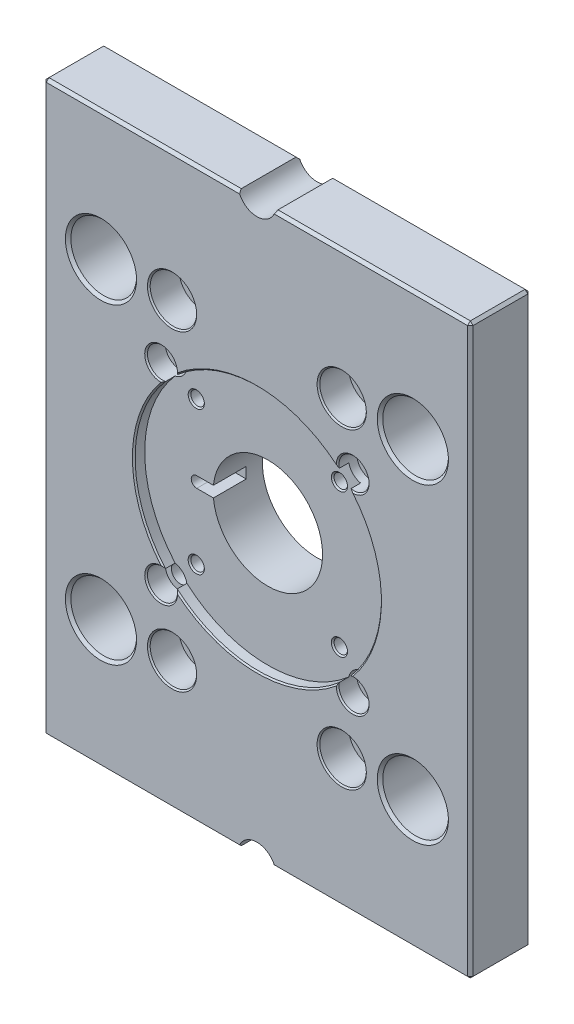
ISO-10303-21;
HEADER;
FILE_DESCRIPTION(('STEP AP214'),'2;1');
FILE_NAME('part.step','',(''),(''),'','','');
FILE_SCHEMA(('AUTOMOTIVE_DESIGN { 1 0 10303 214 1 1 1 1 }'));
ENDSEC;
DATA;
#1=APPLICATION_CONTEXT('core data for automotive mechanical design processes');
#2=APPLICATION_PROTOCOL_DEFINITION('international standard','automotive_design',2000,#1);
#3=PRODUCT_CONTEXT('',#1,'mechanical');
#4=PRODUCT('Part','Part','',(#3));
#5=PRODUCT_RELATED_PRODUCT_CATEGORY('part','',(#4));
#6=PRODUCT_DEFINITION_FORMATION('','',#4);
#7=PRODUCT_DEFINITION_CONTEXT('part definition',#1,'design');
#8=PRODUCT_DEFINITION('design','',#6,#7);
#9=PRODUCT_DEFINITION_SHAPE('','',#8);
#10=(LENGTH_UNIT() NAMED_UNIT(*) SI_UNIT(.MILLI.,.METRE.));
#11=(NAMED_UNIT(*) PLANE_ANGLE_UNIT() SI_UNIT($,.RADIAN.));
#12=(NAMED_UNIT(*) SI_UNIT($,.STERADIAN.) SOLID_ANGLE_UNIT());
#13=UNCERTAINTY_MEASURE_WITH_UNIT(LENGTH_MEASURE(1.E-05),#10,'distance_accuracy_value','');
#14=(GEOMETRIC_REPRESENTATION_CONTEXT(3) GLOBAL_UNCERTAINTY_ASSIGNED_CONTEXT((#13)) GLOBAL_UNIT_ASSIGNED_CONTEXT((#10,
#11,#12)) REPRESENTATION_CONTEXT('',''));
#15=CARTESIAN_POINT('',(0.,0.,0.));
#16=DIRECTION('',(0.,0.,1.));
#17=DIRECTION('',(1.,0.,0.));
#18=AXIS2_PLACEMENT_3D('',#15,#16,#17);
#19=CARTESIAN_POINT('',(0.499999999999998,0.499999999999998,21.));
#20=DIRECTION('',(-0.577350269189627,-0.577350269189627,0.577350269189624));
#21=DIRECTION('',(0.707106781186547,-0.707106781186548,0.));
#22=AXIS2_PLACEMENT_3D('',#19,#20,#21);
#23=PLANE('',#22);
#24=DIRECTION('',(0.707106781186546,0.,0.70710678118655));
#25=VECTOR('',#24,1.);
#26=CARTESIAN_POINT('',(0.499999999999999,0.999999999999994,21.5));
#27=LINE('',#26,#25);
#28=CARTESIAN_POINT('',(0.,0.999999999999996,21.));
#29=VERTEX_POINT('',#28);
#30=CARTESIAN_POINT('',(0.999999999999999,0.999999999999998,22.));
#31=VERTEX_POINT('',#30);
#32=EDGE_CURVE('E194',#29,#31,#27,.T.);
#33=ORIENTED_EDGE('',*,*,#32,.F.);
#34=DIRECTION('',(0.707106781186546,-0.707106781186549,0.));
#35=VECTOR('',#34,1.);
#36=CARTESIAN_POINT('',(0.499999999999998,0.5,21.));
#37=LINE('',#36,#35);
#38=CARTESIAN_POINT('',(1.,0.,21.));
#39=VERTEX_POINT('',#38);
#40=EDGE_CURVE('E531',#39,#29,#37,.F.);
#41=ORIENTED_EDGE('',*,*,#40,.F.);
#42=DIRECTION('',(0.,-0.707106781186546,-0.707106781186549));
#43=VECTOR('',#42,1.);
#44=CARTESIAN_POINT('',(1.,0.499999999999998,21.5));
#45=LINE('',#44,#43);
#46=EDGE_CURVE('E193',#31,#39,#45,.T.);
#47=ORIENTED_EDGE('',*,*,#46,.F.);
#48=EDGE_LOOP('',(#33,#41,#47));
#49=FACE_BOUND('',#48,.T.);
#50=ADVANCED_FACE('F17',(#49),#23,.T.);
#51=CARTESIAN_POINT('',(155.5,0.500000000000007,21.));
#52=DIRECTION('',(0.577350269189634,-0.577350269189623,0.577350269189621));
#53=DIRECTION('',(0.707106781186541,0.707106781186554,0.));
#54=AXIS2_PLACEMENT_3D('',#51,#52,#53);
#55=PLANE('',#54);
#56=DIRECTION('',(0.707106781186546,0.,-0.707106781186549));
#57=VECTOR('',#56,1.);
#58=CARTESIAN_POINT('',(155.5,1.,21.5));
#59=LINE('',#58,#57);
#60=CARTESIAN_POINT('',(155.,0.999999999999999,22.));
#61=VERTEX_POINT('',#60);
#62=CARTESIAN_POINT('',(156.,1.00000000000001,21.));
#63=VERTEX_POINT('',#62);
#64=EDGE_CURVE('E494',#61,#63,#59,.T.);
#65=ORIENTED_EDGE('',*,*,#64,.F.);
#66=DIRECTION('',(0.,-0.707106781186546,-0.707106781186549));
#67=VECTOR('',#66,1.);
#68=CARTESIAN_POINT('',(155.,0.499999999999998,21.5));
#69=LINE('',#68,#67);
#70=CARTESIAN_POINT('',(155.,0.,21.));
#71=VERTEX_POINT('',#70);
#72=EDGE_CURVE('E499',#71,#61,#69,.F.);
#73=ORIENTED_EDGE('',*,*,#72,.F.);
#74=DIRECTION('',(0.707106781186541,0.707106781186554,0.));
#75=VECTOR('',#74,1.);
#76=CARTESIAN_POINT('',(155.5,0.500000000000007,21.));
#77=LINE('',#76,#75);
#78=EDGE_CURVE('E526',#63,#71,#77,.F.);
#79=ORIENTED_EDGE('',*,*,#78,.F.);
#80=EDGE_LOOP('',(#65,#73,#79));
#81=FACE_BOUND('',#80,.T.);
#82=ADVANCED_FACE('F1697',(#81),#55,.T.);
#83=CARTESIAN_POINT('',(0.500000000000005,207.5,21.));
#84=DIRECTION('',(-0.577350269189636,0.577350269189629,0.577350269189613));
#85=DIRECTION('',(-0.707106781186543,-0.707106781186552,0.));
#86=AXIS2_PLACEMENT_3D('',#83,#84,#85);
#87=PLANE('',#86);
#88=DIRECTION('',(0.,-0.70710678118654,0.707106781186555));
#89=VECTOR('',#88,1.);
#90=CARTESIAN_POINT('',(1.00000000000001,207.5,21.5));
#91=LINE('',#90,#89);
#92=CARTESIAN_POINT('',(1.,208.,21.));
#93=VERTEX_POINT('',#92);
#94=CARTESIAN_POINT('',(1.,207.,22.));
#95=VERTEX_POINT('',#94);
#96=EDGE_CURVE('E474',#93,#95,#91,.T.);
#97=ORIENTED_EDGE('',*,*,#96,.F.);
#98=DIRECTION('',(-0.707106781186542,-0.707106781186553,0.));
#99=VECTOR('',#98,1.);
#100=CARTESIAN_POINT('',(0.500000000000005,207.5,21.));
#101=LINE('',#100,#99);
#102=CARTESIAN_POINT('',(0.,207.,21.));
#103=VERTEX_POINT('',#102);
#104=EDGE_CURVE('E480',#103,#93,#101,.F.);
#105=ORIENTED_EDGE('',*,*,#104,.F.);
#106=DIRECTION('',(0.707106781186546,0.,0.70710678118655));
#107=VECTOR('',#106,1.);
#108=CARTESIAN_POINT('',(0.500000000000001,207.,21.5));
#109=LINE('',#108,#107);
#110=EDGE_CURVE('E516',#95,#103,#109,.F.);
#111=ORIENTED_EDGE('',*,*,#110,.F.);
#112=EDGE_LOOP('',(#97,#105,#111));
#113=FACE_BOUND('',#112,.T.);
#114=ADVANCED_FACE('F1689',(#113),#87,.T.);
#115=CARTESIAN_POINT('',(155.5,207.5,21.));
#116=DIRECTION('',(0.577350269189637,0.577350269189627,0.577350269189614));
#117=DIRECTION('',(-0.707106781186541,0.707106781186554,0.));
#118=AXIS2_PLACEMENT_3D('',#115,#116,#117);
#119=PLANE('',#118);
#120=DIRECTION('',(0.,-0.70710678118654,0.707106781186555));
#121=VECTOR('',#120,1.);
#122=CARTESIAN_POINT('',(155.,207.5,21.5));
#123=LINE('',#122,#121);
#124=CARTESIAN_POINT('',(155.,207.,22.));
#125=VERTEX_POINT('',#124);
#126=CARTESIAN_POINT('',(155.,208.,21.));
#127=VERTEX_POINT('',#126);
#128=EDGE_CURVE('E466',#125,#127,#123,.F.);
#129=ORIENTED_EDGE('',*,*,#128,.F.);
#130=DIRECTION('',(0.707106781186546,0.,-0.707106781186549));
#131=VECTOR('',#130,1.);
#132=CARTESIAN_POINT('',(155.5,207.,21.5));
#133=LINE('',#132,#131);
#134=CARTESIAN_POINT('',(156.,207.,21.));
#135=VERTEX_POINT('',#134);
#136=EDGE_CURVE('E490',#135,#125,#133,.F.);
#137=ORIENTED_EDGE('',*,*,#136,.F.);
#138=DIRECTION('',(-0.707106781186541,0.707106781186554,0.));
#139=VECTOR('',#138,1.);
#140=CARTESIAN_POINT('',(155.5,207.5,21.));
#141=LINE('',#140,#139);
#142=EDGE_CURVE('E462',#127,#135,#141,.F.);
#143=ORIENTED_EDGE('',*,*,#142,.F.);
#144=EDGE_LOOP('',(#129,#137,#143));
#145=FACE_BOUND('',#144,.T.);
#146=ADVANCED_FACE('F1681',(#145),#119,.T.);
#147=CARTESIAN_POINT('',(0.499999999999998,0.5,0.));
#148=DIRECTION('',(-0.707106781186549,-0.707106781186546,0.));
#149=DIRECTION('',(0.707106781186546,-0.707106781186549,0.));
#150=AXIS2_PLACEMENT_3D('',#147,#148,#149);
#151=PLANE('',#150);
#152=DIRECTION('',(0.707106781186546,-0.707106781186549,0.));
#153=VECTOR('',#152,1.);
#154=CARTESIAN_POINT('',(0.749999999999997,0.25,1.));
#155=LINE('',#154,#153);
#156=CARTESIAN_POINT('',(1.,0.,1.));
#157=VERTEX_POINT('',#156);
#158=CARTESIAN_POINT('',(0.,0.999999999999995,1.));
#159=VERTEX_POINT('',#158);
#160=EDGE_CURVE('E205',#157,#159,#155,.F.);
#161=ORIENTED_EDGE('',*,*,#160,.F.);
#162=DIRECTION('',(0.,0.,-1.));
#163=VECTOR('',#162,1.);
#164=CARTESIAN_POINT('',(1.,0.,0.));
#165=LINE('',#164,#163);
#166=EDGE_CURVE('E204',#39,#157,#165,.T.);
#167=ORIENTED_EDGE('',*,*,#166,.F.);
#168=ORIENTED_EDGE('',*,*,#40,.T.);
#169=DIRECTION('',(0.,0.,1.));
#170=VECTOR('',#169,1.);
#171=CARTESIAN_POINT('',(0.,0.999999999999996,0.));
#172=LINE('',#171,#170);
#173=EDGE_CURVE('E398',#159,#29,#172,.T.);
#174=ORIENTED_EDGE('',*,*,#173,.F.);
#175=EDGE_LOOP('',(#161,#167,#168,#174));
#176=FACE_BOUND('',#175,.T.);
#177=ADVANCED_FACE('F1673',(#176),#151,.T.);
#178=CARTESIAN_POINT('',(155.5,0.500000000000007,0.));
#179=DIRECTION('',(0.707106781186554,-0.707106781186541,0.));
#180=DIRECTION('',(0.707106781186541,0.707106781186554,0.));
#181=AXIS2_PLACEMENT_3D('',#178,#179,#180);
#182=PLANE('',#181);
#183=DIRECTION('',(0.707106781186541,0.707106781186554,0.));
#184=VECTOR('',#183,1.);
#185=CARTESIAN_POINT('',(155.5,0.500000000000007,1.));
#186=LINE('',#185,#184);
#187=CARTESIAN_POINT('',(155.,0.,1.));
#188=VERTEX_POINT('',#187);
#189=CARTESIAN_POINT('',(156.,1.,1.));
#190=VERTEX_POINT('',#189);
#191=EDGE_CURVE('E521',#188,#190,#186,.T.);
#192=ORIENTED_EDGE('',*,*,#191,.T.);
#193=DIRECTION('',(0.,0.,-1.));
#194=VECTOR('',#193,1.);
#195=CARTESIAN_POINT('',(156.,1.,0.));
#196=LINE('',#195,#194);
#197=EDGE_CURVE('E342',#63,#190,#196,.T.);
#198=ORIENTED_EDGE('',*,*,#197,.F.);
#199=ORIENTED_EDGE('',*,*,#78,.T.);
#200=DIRECTION('',(0.,0.,-1.));
#201=VECTOR('',#200,1.);
#202=CARTESIAN_POINT('',(155.,0.,0.));
#203=LINE('',#202,#201);
#204=EDGE_CURVE('E367',#188,#71,#203,.F.);
#205=ORIENTED_EDGE('',*,*,#204,.F.);
#206=EDGE_LOOP('',(#192,#198,#199,#205));
#207=FACE_BOUND('',#206,.T.);
#208=ADVANCED_FACE('F1665',(#207),#182,.T.);
#209=CARTESIAN_POINT('',(0.499999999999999,52.,21.5));
#210=DIRECTION('',(-0.70710678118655,0.,0.707106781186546));
#211=DIRECTION('',(0.707106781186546,0.,0.70710678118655));
#212=AXIS2_PLACEMENT_3D('',#209,#210,#211);
#213=PLANE('',#212);
#214=ORIENTED_EDGE('',*,*,#32,.T.);
#215=DIRECTION('',(0.,1.,0.));
#216=VECTOR('',#215,1.);
#217=CARTESIAN_POINT('',(1.,104.,22.));
#218=LINE('',#217,#216);
#219=EDGE_CURVE('E331',#95,#31,#218,.F.);
#220=ORIENTED_EDGE('',*,*,#219,.F.);
#221=ORIENTED_EDGE('',*,*,#110,.T.);
#222=DIRECTION('',(0.,1.,0.));
#223=VECTOR('',#222,1.);
#224=CARTESIAN_POINT('',(0.,0.,21.));
#225=LINE('',#224,#223);
#226=EDGE_CURVE('E388',#29,#103,#225,.T.);
#227=ORIENTED_EDGE('',*,*,#226,.F.);
#228=EDGE_LOOP('',(#214,#220,#221,#227));
#229=FACE_BOUND('',#228,.T.);
#230=ADVANCED_FACE('F1658',(#229),#213,.T.);
#231=CARTESIAN_POINT('',(117.,0.499999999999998,21.5));
#232=DIRECTION('',(0.,-0.707106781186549,0.707106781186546));
#233=DIRECTION('',(0.,-0.707106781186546,-0.707106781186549));
#234=AXIS2_PLACEMENT_3D('',#231,#232,#233);
#235=PLANE('',#234);
#236=ORIENTED_EDGE('',*,*,#46,.T.);
#237=DIRECTION('',(1.,0.,0.));
#238=VECTOR('',#237,1.);
#239=CARTESIAN_POINT('',(156.,0.,21.));
#240=LINE('',#239,#238);
#241=CARTESIAN_POINT('',(71.2917960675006,0.,21.));
#242=VERTEX_POINT('',#241);
#243=EDGE_CURVE('E197',#242,#39,#240,.F.);
#244=ORIENTED_EDGE('',*,*,#243,.F.);
#245=CARTESIAN_POINT('',(78.,-1.99999999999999,19.));
#246=DIRECTION('',(0.,-0.707106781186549,0.707106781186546));
#247=DIRECTION('',(0.,-0.707106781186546,-0.707106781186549));
#248=AXIS2_PLACEMENT_3D('',#245,#246,#247);
#249=ELLIPSE('',#248,9.89949493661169,7.);
#250=CARTESIAN_POINT('',(71.6754446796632,0.999999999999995,22.));
#251=VERTEX_POINT('',#250);
#252=EDGE_CURVE('E20',#242,#251,#249,.F.);
#253=ORIENTED_EDGE('',*,*,#252,.T.);
#254=DIRECTION('',(1.,0.,0.));
#255=VECTOR('',#254,1.);
#256=CARTESIAN_POINT('',(78.,1.,22.));
#257=LINE('',#256,#255);
#258=EDGE_CURVE('E327',#31,#251,#257,.T.);
#259=ORIENTED_EDGE('',*,*,#258,.F.);
#260=EDGE_LOOP('',(#236,#244,#253,#259));
#261=FACE_BOUND('',#260,.T.);
#262=ADVANCED_FACE('F198',(#261),#235,.T.);
#263=CARTESIAN_POINT('',(117.,0.499999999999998,21.5));
#264=DIRECTION('',(0.,-0.707106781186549,0.707106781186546));
#265=DIRECTION('',(0.,-0.707106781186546,-0.707106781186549));
#266=AXIS2_PLACEMENT_3D('',#263,#264,#265);
#267=PLANE('',#266);
#268=ORIENTED_EDGE('',*,*,#72,.T.);
#269=DIRECTION('',(1.,0.,0.));
#270=VECTOR('',#269,1.);
#271=CARTESIAN_POINT('',(78.,1.,22.));
#272=LINE('',#271,#270);
#273=CARTESIAN_POINT('',(84.3245553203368,0.999999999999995,22.));
#274=VERTEX_POINT('',#273);
#275=EDGE_CURVE('E324',#274,#61,#272,.T.);
#276=ORIENTED_EDGE('',*,*,#275,.F.);
#277=CARTESIAN_POINT('',(78.,-1.99999999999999,19.));
#278=DIRECTION('',(0.,-0.707106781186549,0.707106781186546));
#279=DIRECTION('',(0.,-0.707106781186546,-0.707106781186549));
#280=AXIS2_PLACEMENT_3D('',#277,#278,#279);
#281=ELLIPSE('',#280,9.89949493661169,7.);
#282=CARTESIAN_POINT('',(84.7082039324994,0.,21.));
#283=VERTEX_POINT('',#282);
#284=EDGE_CURVE('E504',#274,#283,#281,.F.);
#285=ORIENTED_EDGE('',*,*,#284,.T.);
#286=DIRECTION('',(1.,0.,0.));
#287=VECTOR('',#286,1.);
#288=CARTESIAN_POINT('',(156.,0.,21.));
#289=LINE('',#288,#287);
#290=EDGE_CURVE('E364',#71,#283,#289,.F.);
#291=ORIENTED_EDGE('',*,*,#290,.F.);
#292=EDGE_LOOP('',(#268,#276,#285,#291));
#293=FACE_BOUND('',#292,.T.);
#294=ADVANCED_FACE('F1643',(#293),#267,.T.);
#295=CARTESIAN_POINT('',(155.5,156.,21.5));
#296=DIRECTION('',(0.707106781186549,0.,0.707106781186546));
#297=DIRECTION('',(0.707106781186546,0.,-0.707106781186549));
#298=AXIS2_PLACEMENT_3D('',#295,#296,#297);
#299=PLANE('',#298);
#300=ORIENTED_EDGE('',*,*,#136,.T.);
#301=DIRECTION('',(0.,1.,0.));
#302=VECTOR('',#301,1.);
#303=CARTESIAN_POINT('',(155.,104.,22.));
#304=LINE('',#303,#302);
#305=EDGE_CURVE('E321',#61,#125,#304,.T.);
#306=ORIENTED_EDGE('',*,*,#305,.F.);
#307=ORIENTED_EDGE('',*,*,#64,.T.);
#308=DIRECTION('',(0.,1.,0.));
#309=VECTOR('',#308,1.);
#310=CARTESIAN_POINT('',(156.,208.,21.));
#311=LINE('',#310,#309);
#312=EDGE_CURVE('E358',#135,#63,#311,.F.);
#313=ORIENTED_EDGE('',*,*,#312,.F.);
#314=EDGE_LOOP('',(#300,#306,#307,#313));
#315=FACE_BOUND('',#314,.T.);
#316=ADVANCED_FACE('F1635',(#315),#299,.T.);
#317=CARTESIAN_POINT('',(109.,47.,22.0000000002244));
#318=DIRECTION('',(0.,0.,1.));
#319=DIRECTION('',(1.,0.,0.));
#320=AXIS2_PLACEMENT_3D('',#317,#318,#319);
#321=CONICAL_SURFACE('',#320,8.99999999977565,0.785398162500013);
#322=CARTESIAN_POINT('',(109.,47.,22.0000000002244));
#323=DIRECTION('',(0.,0.,1.));
#324=DIRECTION('',(1.,0.,0.));
#325=AXIS2_PLACEMENT_3D('',#322,#323,#324);
#326=CIRCLE('',#325,8.99999999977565);
#327=CARTESIAN_POINT('',(117.999999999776,47.,22.0000000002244));
#328=VERTEX_POINT('',#327);
#329=EDGE_CURVE('E320',#328,#328,#326,.F.);
#330=ORIENTED_EDGE('',*,*,#329,.F.);
#331=EDGE_LOOP('',(#330));
#332=FACE_BOUND('',#331,.T.);
#333=CARTESIAN_POINT('',(109.,47.,21.5));
#334=DIRECTION('',(0.,0.,1.));
#335=DIRECTION('',(1.,0.,0.));
#336=AXIS2_PLACEMENT_3D('',#333,#334,#335);
#337=CIRCLE('',#336,8.5);
#338=CARTESIAN_POINT('',(117.5,47.,21.5));
#339=VERTEX_POINT('',#338);
#340=EDGE_CURVE('E420',#339,#339,#337,.F.);
#341=ORIENTED_EDGE('',*,*,#340,.T.);
#342=EDGE_LOOP('',(#341));
#343=FACE_BOUND('',#342,.T.);
#344=ADVANCED_FACE('F1627',(#332,#343),#321,.F.);
#345=CARTESIAN_POINT('',(47.,161.,22.0000000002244));
#346=DIRECTION('',(0.,0.,1.));
#347=DIRECTION('',(1.,0.,0.));
#348=AXIS2_PLACEMENT_3D('',#345,#346,#347);
#349=CONICAL_SURFACE('',#348,8.99999999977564,0.785398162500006);
#350=CARTESIAN_POINT('',(47.,161.,22.0000000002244));
#351=DIRECTION('',(0.,0.,1.));
#352=DIRECTION('',(1.,0.,0.));
#353=AXIS2_PLACEMENT_3D('',#350,#351,#352);
#354=CIRCLE('',#353,8.99999999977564);
#355=CARTESIAN_POINT('',(55.9999999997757,161.,22.0000000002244));
#356=VERTEX_POINT('',#355);
#357=EDGE_CURVE('E750',#356,#356,#354,.F.);
#358=ORIENTED_EDGE('',*,*,#357,.F.);
#359=EDGE_LOOP('',(#358));
#360=FACE_BOUND('',#359,.T.);
#361=CARTESIAN_POINT('',(47.,161.,21.5));
#362=DIRECTION('',(0.,0.,1.));
#363=DIRECTION('',(1.,0.,0.));
#364=AXIS2_PLACEMENT_3D('',#361,#362,#363);
#365=CIRCLE('',#364,8.5);
#366=CARTESIAN_POINT('',(55.5,161.,21.5));
#367=VERTEX_POINT('',#366);
#368=EDGE_CURVE('E411',#367,#367,#365,.F.);
#369=ORIENTED_EDGE('',*,*,#368,.T.);
#370=EDGE_LOOP('',(#369));
#371=FACE_BOUND('',#370,.T.);
#372=ADVANCED_FACE('F1620',(#360,#371),#349,.F.);
#373=CARTESIAN_POINT('',(47.,47.,22.0000000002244));
#374=DIRECTION('',(0.,0.,1.));
#375=DIRECTION('',(1.,0.,0.));
#376=AXIS2_PLACEMENT_3D('',#373,#374,#375);
#377=CONICAL_SURFACE('',#376,8.99999999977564,0.785398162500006);
#378=CARTESIAN_POINT('',(47.,47.,22.0000000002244));
#379=DIRECTION('',(0.,0.,1.));
#380=DIRECTION('',(1.,0.,0.));
#381=AXIS2_PLACEMENT_3D('',#378,#379,#380);
#382=CIRCLE('',#381,8.99999999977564);
#383=CARTESIAN_POINT('',(55.9999999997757,47.,22.0000000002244));
#384=VERTEX_POINT('',#383);
#385=EDGE_CURVE('E747',#384,#384,#382,.F.);
#386=ORIENTED_EDGE('',*,*,#385,.F.);
#387=EDGE_LOOP('',(#386));
#388=FACE_BOUND('',#387,.T.);
#389=CARTESIAN_POINT('',(47.,47.,21.5));
#390=DIRECTION('',(0.,0.,1.));
#391=DIRECTION('',(1.,0.,0.));
#392=AXIS2_PLACEMENT_3D('',#389,#390,#391);
#393=CIRCLE('',#392,8.5);
#394=CARTESIAN_POINT('',(55.5,47.,21.5));
#395=VERTEX_POINT('',#394);
#396=EDGE_CURVE('E415',#395,#395,#393,.F.);
#397=ORIENTED_EDGE('',*,*,#396,.T.);
#398=EDGE_LOOP('',(#397));
#399=FACE_BOUND('',#398,.T.);
#400=ADVANCED_FACE('F847',(#388,#399),#377,.F.);
#401=CARTESIAN_POINT('',(43.,69.,22.0000000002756));
#402=DIRECTION('',(0.,0.,1.));
#403=DIRECTION('',(1.,0.,0.));
#404=AXIS2_PLACEMENT_3D('',#401,#402,#403);
#405=CONICAL_SURFACE('',#404,5.99999999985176,0.785398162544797);
#406=CARTESIAN_POINT('',(43.,69.,21.5));
#407=DIRECTION('',(0.,0.,1.));
#408=DIRECTION('',(1.,0.,0.));
#409=AXIS2_PLACEMENT_3D('',#406,#407,#408);
#410=CIRCLE('',#409,5.5);
#411=CARTESIAN_POINT('',(48.3879921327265,70.1043282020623,21.4999999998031));
#412=VERTEX_POINT('',#411);
#413=CARTESIAN_POINT('',(44.1043282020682,74.3879921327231,21.4999999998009));
#414=VERTEX_POINT('',#413);
#415=EDGE_CURVE('E451',#412,#414,#410,.F.);
#416=ORIENTED_EDGE('',*,*,#415,.T.);
#417=CARTESIAN_POINT('',(44.1043282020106,74.3879921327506,21.4999999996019));
#418=CARTESIAN_POINT('',(44.0070246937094,74.4446714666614,21.5359881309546));
#419=CARTESIAN_POINT('',(43.9094418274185,74.499849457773,21.5735537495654));
#420=CARTESIAN_POINT('',(43.7139623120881,74.6072631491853,21.651569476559));
#421=CARTESIAN_POINT('',(43.6160661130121,74.6595019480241,21.6920164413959));
#422=CARTESIAN_POINT('',(43.4200077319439,74.7612124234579,21.775597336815));
#423=CARTESIAN_POINT('',(43.321845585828,74.8106844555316,21.8187309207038));
#424=CARTESIAN_POINT('',(43.1252452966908,74.9070484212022,21.9075282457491));
#425=CARTESIAN_POINT('',(43.026806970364,74.9539375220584,21.9531946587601));
#426=CARTESIAN_POINT('',(42.9283375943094,74.9995720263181,22.0000000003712));
#427=B_SPLINE_CURVE_WITH_KNOTS('',3,(#417,#418,#419,#420,#421,#422,#423,#424,#425,#426),
.UNSPECIFIED.,.F.,.F.,(4,2,2,2,4),(0.,0.354621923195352,0.708862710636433,1.06305787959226,
1.41763406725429),.UNSPECIFIED.);
#428=CARTESIAN_POINT('',(42.9283375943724,74.9995720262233,22.0000000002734));
#429=VERTEX_POINT('',#428);
#430=EDGE_CURVE('E493',#414,#429,#427,.T.);
#431=ORIENTED_EDGE('',*,*,#430,.T.);
#432=CARTESIAN_POINT('',(43.,69.,22.0000000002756));
#433=DIRECTION('',(0.,0.,1.));
#434=DIRECTION('',(1.,0.,0.));
#435=AXIS2_PLACEMENT_3D('',#432,#433,#434);
#436=CIRCLE('',#435,5.99999999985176);
#437=CARTESIAN_POINT('',(48.999572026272,68.9283375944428,22.0000000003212));
#438=VERTEX_POINT('',#437);
#439=EDGE_CURVE('E733',#438,#429,#436,.F.);
#440=ORIENTED_EDGE('',*,*,#439,.F.);
#441=CARTESIAN_POINT('',(48.9995720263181,68.9283375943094,22.0000000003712));
#442=CARTESIAN_POINT('',(48.9539375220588,69.026806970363,21.9531946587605));
#443=CARTESIAN_POINT('',(48.9070484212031,69.1252452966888,21.90752824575));
#444=CARTESIAN_POINT('',(48.8106844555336,69.3218455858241,21.8187309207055));
#445=CARTESIAN_POINT('',(48.7612124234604,69.4200077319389,21.7755973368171));
#446=CARTESIAN_POINT('',(48.6595019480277,69.6160661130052,21.6920164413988));
#447=CARTESIAN_POINT('',(48.6072631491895,69.7139623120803,21.6515694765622));
#448=CARTESIAN_POINT('',(48.4998494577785,69.9094418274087,21.5735537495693));
#449=CARTESIAN_POINT('',(48.4446714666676,70.0070246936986,21.5359881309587));
#450=CARTESIAN_POINT('',(48.3879921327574,70.1043282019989,21.4999999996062));
#451=B_SPLINE_CURVE_WITH_KNOTS('',3,(#441,#442,#443,#444,#445,#446,#447,#448,#449,#450),
.UNSPECIFIED.,.F.,.F.,(4,2,2,2,4),(0.,0.354576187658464,0.708771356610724,1.06301214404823,
1.41763406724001),.UNSPECIFIED.);
#452=EDGE_CURVE('E483',#438,#412,#451,.T.);
#453=ORIENTED_EDGE('',*,*,#452,.T.);
#454=EDGE_LOOP('',(#416,#431,#440,#453));
#455=FACE_BOUND('',#454,.T.);
#456=ADVANCED_FACE('F769',(#455),#405,.F.);
#457=CARTESIAN_POINT('',(78.,104.,22.0000000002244));
#458=DIRECTION('',(0.,0.,1.));
#459=DIRECTION('',(1.,0.,0.));
#460=AXIS2_PLACEMENT_3D('',#457,#458,#459);
#461=CONICAL_SURFACE('',#460,45.5087499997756,0.785398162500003);
#462=CARTESIAN_POINT('',(44.1043282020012,133.612007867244,21.4999999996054));
#463=CARTESIAN_POINT('',(44.0070246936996,133.555328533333,21.5359881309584));
#464=CARTESIAN_POINT('',(43.9094418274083,133.500150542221,21.5735537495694));
#465=CARTESIAN_POINT('',(43.7139623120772,133.392736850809,21.6515694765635));
#466=CARTESIAN_POINT('',(43.6160661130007,133.34049805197,21.6920164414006));
#467=CARTESIAN_POINT('',(43.4200077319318,133.238787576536,21.7755973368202));
#468=CARTESIAN_POINT('',(43.3218455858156,133.189315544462,21.8187309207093));
#469=CARTESIAN_POINT('',(43.1252452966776,133.092951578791,21.9075282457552));
#470=CARTESIAN_POINT('',(43.0268069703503,133.046062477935,21.9531946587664));
#471=CARTESIAN_POINT('',(42.9283375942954,133.000427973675,22.0000000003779));
#472=B_SPLINE_CURVE_WITH_KNOTS('',3,(#462,#463,#464,#465,#466,#467,#468,#469,#470,#471),
.UNSPECIFIED.,.F.,.F.,(4,2,2,2,4),(0.,0.354621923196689,0.708862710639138,1.0630578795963,
1.41763406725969),.UNSPECIFIED.);
#473=CARTESIAN_POINT('',(44.1043282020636,133.612007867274,21.4999999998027));
#474=VERTEX_POINT('',#473);
#475=CARTESIAN_POINT('',(42.928337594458,133.000427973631,22.0000000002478));
#476=VERTEX_POINT('',#475);
#477=EDGE_CURVE('E827',#474,#476,#472,.T.);
#478=ORIENTED_EDGE('',*,*,#477,.T.);
#479=CARTESIAN_POINT('',(78.,104.,22.0000000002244));
#480=DIRECTION('',(0.,0.,1.));
#481=DIRECTION('',(1.,0.,0.));
#482=AXIS2_PLACEMENT_3D('',#479,#480,#481);
#483=CIRCLE('',#482,45.5087499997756);
#484=EDGE_CURVE('E731',#429,#476,#483,.F.);
#485=ORIENTED_EDGE('',*,*,#484,.F.);
#486=ORIENTED_EDGE('',*,*,#430,.F.);
#487=CARTESIAN_POINT('',(78.,104.,21.5));
#488=DIRECTION('',(0.,0.,1.));
#489=DIRECTION('',(1.,0.,0.));
#490=AXIS2_PLACEMENT_3D('',#487,#488,#489);
#491=CIRCLE('',#490,45.00875);
#492=EDGE_CURVE('E548',#414,#474,#491,.F.);
#493=ORIENTED_EDGE('',*,*,#492,.T.);
#494=EDGE_LOOP('',(#478,#485,#486,#493));
#495=FACE_BOUND('',#494,.T.);
#496=ADVANCED_FACE('F836',(#495),#461,.F.);
#497=CARTESIAN_POINT('',(43.,139.,22.0000000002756));
#498=DIRECTION('',(0.,0.,1.));
#499=DIRECTION('',(1.,0.,0.));
#500=AXIS2_PLACEMENT_3D('',#497,#498,#499);
#501=CONICAL_SURFACE('',#500,5.99999999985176,0.785398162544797);
#502=CARTESIAN_POINT('',(43.,139.,21.5));
#503=DIRECTION('',(0.,0.,1.));
#504=DIRECTION('',(1.,0.,0.));
#505=AXIS2_PLACEMENT_3D('',#502,#503,#504);
#506=CIRCLE('',#505,5.5);
#507=CARTESIAN_POINT('',(48.387992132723,137.895671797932,21.4999999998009));
#508=VERTEX_POINT('',#507);
#509=EDGE_CURVE('E441',#474,#508,#506,.F.);
#510=ORIENTED_EDGE('',*,*,#509,.T.);
#511=CARTESIAN_POINT('',(48.3879921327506,137.895671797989,21.4999999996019));
#512=CARTESIAN_POINT('',(48.4446714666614,137.992975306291,21.5359881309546));
#513=CARTESIAN_POINT('',(48.499849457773,138.090558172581,21.5735537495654));
#514=CARTESIAN_POINT('',(48.6072631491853,138.286037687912,21.651569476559));
#515=CARTESIAN_POINT('',(48.6595019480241,138.383933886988,21.6920164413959));
#516=CARTESIAN_POINT('',(48.7612124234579,138.579992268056,21.775597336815));
#517=CARTESIAN_POINT('',(48.8106844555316,138.678154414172,21.8187309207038));
#518=CARTESIAN_POINT('',(48.9070484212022,138.874754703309,21.9075282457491));
#519=CARTESIAN_POINT('',(48.9539375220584,138.973193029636,21.9531946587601));
#520=CARTESIAN_POINT('',(48.9995720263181,139.071662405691,22.0000000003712));
#521=B_SPLINE_CURVE_WITH_KNOTS('',3,(#511,#512,#513,#514,#515,#516,#517,#518,#519,#520),
.UNSPECIFIED.,.F.,.F.,(4,2,2,2,4),(0.,0.354621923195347,0.708862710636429,1.06305787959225,
1.4176340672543),.UNSPECIFIED.);
#522=CARTESIAN_POINT('',(48.9995720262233,139.071662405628,22.0000000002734));
#523=VERTEX_POINT('',#522);
#524=EDGE_CURVE('E821',#508,#523,#521,.T.);
#525=ORIENTED_EDGE('',*,*,#524,.T.);
#526=CARTESIAN_POINT('',(43.,139.,22.0000000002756));
#527=DIRECTION('',(0.,0.,1.));
#528=DIRECTION('',(1.,0.,0.));
#529=AXIS2_PLACEMENT_3D('',#526,#527,#528);
#530=CIRCLE('',#529,5.99999999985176);
#531=EDGE_CURVE('E729',#476,#523,#530,.F.);
#532=ORIENTED_EDGE('',*,*,#531,.F.);
#533=ORIENTED_EDGE('',*,*,#477,.F.);
#534=EDGE_LOOP('',(#510,#525,#532,#533));
#535=FACE_BOUND('',#534,.T.);
#536=ADVANCED_FACE('F817',(#535),#501,.F.);
#537=CARTESIAN_POINT('',(78.,104.,22.0000000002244));
#538=DIRECTION('',(0.,0.,1.));
#539=DIRECTION('',(1.,0.,0.));
#540=AXIS2_PLACEMENT_3D('',#537,#538,#539);
#541=CONICAL_SURFACE('',#540,45.5087499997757,0.78539816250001);
#542=CARTESIAN_POINT('',(107.612007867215,137.895671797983,21.4999999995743));
#543=CARTESIAN_POINT('',(107.555328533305,137.992975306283,21.5359881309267));
#544=CARTESIAN_POINT('',(107.500150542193,138.090558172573,21.5735537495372));
#545=CARTESIAN_POINT('',(107.392736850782,138.286037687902,21.65156947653));
#546=CARTESIAN_POINT('',(107.340498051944,138.383933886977,21.6920164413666));
#547=CARTESIAN_POINT('',(107.23878757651,138.579992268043,21.7755973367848));
#548=CARTESIAN_POINT('',(107.189315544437,138.678154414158,21.8187309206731));
#549=CARTESIAN_POINT('',(107.092951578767,138.874754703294,21.9075282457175));
#550=CARTESIAN_POINT('',(107.046062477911,138.97319302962,21.9531946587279));
#551=CARTESIAN_POINT('',(107.000427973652,139.071662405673,22.0000000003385));
#552=B_SPLINE_CURVE_WITH_KNOTS('',3,(#542,#543,#544,#545,#546,#547,#548,#549,#550,#551),
.UNSPECIFIED.,.F.,.F.,(4,2,2,2,4),(0.,0.354621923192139,0.708862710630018,1.06305787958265,
1.41763406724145),.UNSPECIFIED.);
#553=CARTESIAN_POINT('',(107.61200786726,137.895671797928,21.4999999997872));
#554=VERTEX_POINT('',#553);
#555=CARTESIAN_POINT('',(107.000427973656,139.071662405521,22.0000000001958));
#556=VERTEX_POINT('',#555);
#557=EDGE_CURVE('E802',#554,#556,#552,.T.);
#558=ORIENTED_EDGE('',*,*,#557,.T.);
#559=CARTESIAN_POINT('',(78.,104.,22.0000000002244));
#560=DIRECTION('',(0.,0.,1.));
#561=DIRECTION('',(1.,0.,0.));
#562=AXIS2_PLACEMENT_3D('',#559,#560,#561);
#563=CIRCLE('',#562,45.5087499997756);
#564=EDGE_CURVE('E727',#523,#556,#563,.F.);
#565=ORIENTED_EDGE('',*,*,#564,.F.);
#566=ORIENTED_EDGE('',*,*,#524,.F.);
#567=CARTESIAN_POINT('',(78.,104.,21.5));
#568=DIRECTION('',(0.,0.,1.));
#569=DIRECTION('',(1.,0.,0.));
#570=AXIS2_PLACEMENT_3D('',#567,#568,#569);
#571=CIRCLE('',#570,45.00875);
#572=EDGE_CURVE('E465',#508,#554,#571,.F.);
#573=ORIENTED_EDGE('',*,*,#572,.T.);
#574=EDGE_LOOP('',(#558,#565,#566,#573));
#575=FACE_BOUND('',#574,.T.);
#576=ADVANCED_FACE('F811',(#575),#541,.F.);
#577=CARTESIAN_POINT('',(113.,139.,22.0000000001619));
#578=DIRECTION('',(0.,0.,1.));
#579=DIRECTION('',(1.,0.,0.));
#580=AXIS2_PLACEMENT_3D('',#577,#578,#579);
#581=CONICAL_SURFACE('',#580,5.99999999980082,0.785398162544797);
#582=CARTESIAN_POINT('',(113.,139.,21.5));
#583=DIRECTION('',(0.,0.,1.));
#584=DIRECTION('',(1.,0.,0.));
#585=AXIS2_PLACEMENT_3D('',#582,#583,#584);
#586=CIRCLE('',#585,5.5);
#587=CARTESIAN_POINT('',(111.895671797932,133.612007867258,21.4999999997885));
#588=VERTEX_POINT('',#587);
#589=EDGE_CURVE('E399',#554,#588,#586,.F.);
#590=ORIENTED_EDGE('',*,*,#589,.T.);
#591=CARTESIAN_POINT('',(111.89567179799,133.612007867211,21.4999999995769));
#592=CARTESIAN_POINT('',(111.99297530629,133.555328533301,21.5359881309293));
#593=CARTESIAN_POINT('',(112.09055817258,133.50015054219,21.5735537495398));
#594=CARTESIAN_POINT('',(112.286037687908,133.392736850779,21.6515694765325));
#595=CARTESIAN_POINT('',(112.383933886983,133.34049805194,21.692016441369));
#596=CARTESIAN_POINT('',(112.579992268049,133.238787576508,21.7755973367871));
#597=CARTESIAN_POINT('',(112.678154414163,133.189315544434,21.8187309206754));
#598=CARTESIAN_POINT('',(112.874754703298,133.092951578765,21.9075282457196));
#599=CARTESIAN_POINT('',(112.973193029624,133.046062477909,21.9531946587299));
#600=CARTESIAN_POINT('',(113.071662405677,133.00042797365,22.0000000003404));
#601=B_SPLINE_CURVE_WITH_KNOTS('',3,(#591,#592,#593,#594,#595,#596,#597,#598,#599,#600),
.UNSPECIFIED.,.F.,.F.,(4,2,2,2,4),(0.,0.354621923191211,0.708862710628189,1.06305787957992,
1.41763406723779),.UNSPECIFIED.);
#602=CARTESIAN_POINT('',(113.071662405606,133.000427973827,22.0000000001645));
#603=VERTEX_POINT('',#602);
#604=EDGE_CURVE('E796',#588,#603,#601,.T.);
#605=ORIENTED_EDGE('',*,*,#604,.T.);
#606=CARTESIAN_POINT('',(113.,139.,22.0000000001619));
#607=DIRECTION('',(0.,0.,1.));
#608=DIRECTION('',(1.,0.,0.));
#609=AXIS2_PLACEMENT_3D('',#606,#607,#608);
#610=CIRCLE('',#609,5.99999999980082);
#611=EDGE_CURVE('E725',#556,#603,#610,.F.);
#612=ORIENTED_EDGE('',*,*,#611,.F.);
#613=ORIENTED_EDGE('',*,*,#557,.F.);
#614=EDGE_LOOP('',(#590,#605,#612,#613));
#615=FACE_BOUND('',#614,.T.);
#616=ADVANCED_FACE('F808',(#615),#581,.F.);
#617=CARTESIAN_POINT('',(78.,104.,22.0000000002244));
#618=DIRECTION('',(0.,0.,1.));
#619=DIRECTION('',(1.,0.,0.));
#620=AXIS2_PLACEMENT_3D('',#617,#618,#619);
#621=CONICAL_SURFACE('',#620,45.5087499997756,0.785398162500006);
#622=CARTESIAN_POINT('',(111.895671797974,74.3879921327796,21.4999999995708));
#623=CARTESIAN_POINT('',(111.992975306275,74.4446714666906,21.5359881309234));
#624=CARTESIAN_POINT('',(112.090558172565,74.4998494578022,21.5735537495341));
#625=CARTESIAN_POINT('',(112.286037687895,74.6072631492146,21.6515694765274));
#626=CARTESIAN_POINT('',(112.383933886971,74.6595019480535,21.6920164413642));
#627=CARTESIAN_POINT('',(112.579992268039,74.7612124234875,21.775597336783));
#628=CARTESIAN_POINT('',(112.678154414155,74.8106844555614,21.8187309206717));
#629=CARTESIAN_POINT('',(112.874754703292,74.9070484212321,21.9075282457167));
#630=CARTESIAN_POINT('',(112.973193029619,74.9539375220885,21.9531946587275));
#631=CARTESIAN_POINT('',(113.071662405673,74.9995720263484,22.0000000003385));
#632=B_SPLINE_CURVE_WITH_KNOTS('',3,(#622,#623,#624,#625,#626,#627,#628,#629,#630,#631),
.UNSPECIFIED.,.F.,.F.,(4,2,2,2,4),(0.,0.354621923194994,0.708862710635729,1.06305787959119,
1.41763406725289),.UNSPECIFIED.);
#633=CARTESIAN_POINT('',(111.895671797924,74.3879921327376,21.4999999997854));
#634=VERTEX_POINT('',#633);
#635=CARTESIAN_POINT('',(113.071662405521,74.9995720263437,22.0000000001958));
#636=VERTEX_POINT('',#635);
#637=EDGE_CURVE('E790',#634,#636,#632,.T.);
#638=ORIENTED_EDGE('',*,*,#637,.T.);
#639=CARTESIAN_POINT('',(78.,104.,22.0000000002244));
#640=DIRECTION('',(0.,0.,1.));
#641=DIRECTION('',(1.,0.,0.));
#642=AXIS2_PLACEMENT_3D('',#639,#640,#641);
#643=CIRCLE('',#642,45.5087499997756);
#644=EDGE_CURVE('E723',#603,#636,#643,.F.);
#645=ORIENTED_EDGE('',*,*,#644,.F.);
#646=ORIENTED_EDGE('',*,*,#604,.F.);
#647=CARTESIAN_POINT('',(78.,104.,21.5));
#648=DIRECTION('',(0.,0.,1.));
#649=DIRECTION('',(1.,0.,0.));
#650=AXIS2_PLACEMENT_3D('',#647,#648,#649);
#651=CIRCLE('',#650,45.00875);
#652=EDGE_CURVE('E430',#588,#634,#651,.F.);
#653=ORIENTED_EDGE('',*,*,#652,.T.);
#654=EDGE_LOOP('',(#638,#645,#646,#653));
#655=FACE_BOUND('',#654,.T.);
#656=ADVANCED_FACE('F785',(#655),#621,.F.);
#657=CARTESIAN_POINT('',(113.,69.,22.0000000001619));
#658=DIRECTION('',(0.,0.,1.));
#659=DIRECTION('',(1.,0.,0.));
#660=AXIS2_PLACEMENT_3D('',#657,#658,#659);
#661=CONICAL_SURFACE('',#660,5.99999999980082,0.785398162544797);
#662=CARTESIAN_POINT('',(113.,69.,21.5));
#663=DIRECTION('',(0.,0.,1.));
#664=DIRECTION('',(1.,0.,0.));
#665=AXIS2_PLACEMENT_3D('',#662,#663,#664);
#666=CIRCLE('',#665,5.5);
#667=CARTESIAN_POINT('',(107.61200786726,70.1043282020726,21.4999999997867));
#668=VERTEX_POINT('',#667);
#669=EDGE_CURVE('E444',#634,#668,#666,.F.);
#670=ORIENTED_EDGE('',*,*,#669,.T.);
#671=CARTESIAN_POINT('',(107.612007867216,70.1043282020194,21.4999999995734));
#672=CARTESIAN_POINT('',(107.555328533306,70.0070246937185,21.535988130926));
#673=CARTESIAN_POINT('',(107.500150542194,69.909441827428,21.5735537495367));
#674=CARTESIAN_POINT('',(107.392736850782,69.7139623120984,21.6515694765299));
#675=CARTESIAN_POINT('',(107.340498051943,69.6160661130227,21.6920164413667));
#676=CARTESIAN_POINT('',(107.23878757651,69.4200077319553,21.7755973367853));
#677=CARTESIAN_POINT('',(107.189315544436,69.3218455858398,21.818730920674));
#678=CARTESIAN_POINT('',(107.092951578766,69.1252452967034,21.9075282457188));
#679=CARTESIAN_POINT('',(107.046062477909,69.0268069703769,21.9531946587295));
#680=CARTESIAN_POINT('',(107.00042797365,68.9283375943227,22.0000000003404));
#681=B_SPLINE_CURVE_WITH_KNOTS('',3,(#671,#672,#673,#674,#675,#676,#677,#678,#679,#680),
.UNSPECIFIED.,.F.,.F.,(4,2,2,2,4),(0.,0.354621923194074,0.708862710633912,1.06305787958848,
1.41763406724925),.UNSPECIFIED.);
#682=CARTESIAN_POINT('',(107.000427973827,68.9283375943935,22.0000000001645));
#683=VERTEX_POINT('',#682);
#684=EDGE_CURVE('E763',#668,#683,#681,.T.);
#685=ORIENTED_EDGE('',*,*,#684,.T.);
#686=CARTESIAN_POINT('',(113.,69.,22.0000000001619));
#687=DIRECTION('',(0.,0.,1.));
#688=DIRECTION('',(1.,0.,0.));
#689=AXIS2_PLACEMENT_3D('',#686,#687,#688);
#690=CIRCLE('',#689,5.99999999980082);
#691=EDGE_CURVE('E721',#636,#683,#690,.F.);
#692=ORIENTED_EDGE('',*,*,#691,.F.);
#693=ORIENTED_EDGE('',*,*,#637,.F.);
#694=EDGE_LOOP('',(#670,#685,#692,#693));
#695=FACE_BOUND('',#694,.T.);
#696=ADVANCED_FACE('F778',(#695),#661,.F.);
#697=CARTESIAN_POINT('',(78.,104.,22.0000000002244));
#698=DIRECTION('',(0.,0.,1.));
#699=DIRECTION('',(1.,0.,0.));
#700=AXIS2_PLACEMENT_3D('',#697,#698,#699);
#701=CONICAL_SURFACE('',#700,45.5087499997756,0.785398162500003);
#702=ORIENTED_EDGE('',*,*,#452,.F.);
#703=CARTESIAN_POINT('',(78.,104.,22.0000000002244));
#704=DIRECTION('',(0.,0.,1.));
#705=DIRECTION('',(1.,0.,0.));
#706=AXIS2_PLACEMENT_3D('',#703,#704,#705);
#707=CIRCLE('',#706,45.5087499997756);
#708=EDGE_CURVE('E718',#683,#438,#707,.F.);
#709=ORIENTED_EDGE('',*,*,#708,.F.);
#710=ORIENTED_EDGE('',*,*,#684,.F.);
#711=CARTESIAN_POINT('',(78.,104.,21.5));
#712=DIRECTION('',(0.,0.,1.));
#713=DIRECTION('',(1.,0.,0.));
#714=AXIS2_PLACEMENT_3D('',#711,#712,#713);
#715=CIRCLE('',#714,45.00875);
#716=EDGE_CURVE('E551',#668,#412,#715,.F.);
#717=ORIENTED_EDGE('',*,*,#716,.T.);
#718=EDGE_LOOP('',(#702,#709,#710,#717));
#719=FACE_BOUND('',#718,.T.);
#720=ADVANCED_FACE('F773',(#719),#701,.F.);
#721=CARTESIAN_POINT('',(109.,161.,22.0000000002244));
#722=DIRECTION('',(0.,0.,1.));
#723=DIRECTION('',(1.,0.,0.));
#724=AXIS2_PLACEMENT_3D('',#721,#722,#723);
#725=CONICAL_SURFACE('',#724,8.99999999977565,0.785398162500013);
#726=CARTESIAN_POINT('',(109.,161.,22.0000000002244));
#727=DIRECTION('',(0.,0.,1.));
#728=DIRECTION('',(1.,0.,0.));
#729=AXIS2_PLACEMENT_3D('',#726,#727,#728);
#730=CIRCLE('',#729,8.99999999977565);
#731=CARTESIAN_POINT('',(117.999999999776,161.,22.0000000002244));
#732=VERTEX_POINT('',#731);
#733=EDGE_CURVE('E408',#732,#732,#730,.F.);
#734=ORIENTED_EDGE('',*,*,#733,.F.);
#735=EDGE_LOOP('',(#734));
#736=FACE_BOUND('',#735,.T.);
#737=CARTESIAN_POINT('',(109.,161.,21.5));
#738=DIRECTION('',(0.,0.,1.));
#739=DIRECTION('',(1.,0.,0.));
#740=AXIS2_PLACEMENT_3D('',#737,#738,#739);
#741=CIRCLE('',#740,8.5);
#742=CARTESIAN_POINT('',(117.5,161.,21.5));
#743=VERTEX_POINT('',#742);
#744=EDGE_CURVE('E425',#743,#743,#741,.F.);
#745=ORIENTED_EDGE('',*,*,#744,.T.);
#746=EDGE_LOOP('',(#745));
#747=FACE_BOUND('',#746,.T.);
#748=ADVANCED_FACE('F777',(#736,#747),#725,.F.);
#749=CARTESIAN_POINT('',(0.500000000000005,207.5,0.));
#750=DIRECTION('',(-0.707106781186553,0.707106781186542,0.));
#751=DIRECTION('',(-0.707106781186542,-0.707106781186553,0.));
#752=AXIS2_PLACEMENT_3D('',#749,#750,#751);
#753=PLANE('',#752);
#754=DIRECTION('',(-0.707106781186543,-0.707106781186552,0.));
#755=VECTOR('',#754,1.);
#756=CARTESIAN_POINT('',(0.750000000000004,207.75,1.00000000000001));
#757=LINE('',#756,#755);
#758=CARTESIAN_POINT('',(0.,207.,1.));
#759=VERTEX_POINT('',#758);
#760=CARTESIAN_POINT('',(1.,208.,1.00000000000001));
#761=VERTEX_POINT('',#760);
#762=EDGE_CURVE('E380',#759,#761,#757,.F.);
#763=ORIENTED_EDGE('',*,*,#762,.F.);
#764=DIRECTION('',(0.,0.,1.));
#765=VECTOR('',#764,1.);
#766=CARTESIAN_POINT('',(0.,207.,0.));
#767=LINE('',#766,#765);
#768=EDGE_CURVE('E395',#103,#759,#767,.F.);
#769=ORIENTED_EDGE('',*,*,#768,.F.);
#770=ORIENTED_EDGE('',*,*,#104,.T.);
#771=DIRECTION('',(0.,0.,1.));
#772=VECTOR('',#771,1.);
#773=CARTESIAN_POINT('',(1.,208.,0.));
#774=LINE('',#773,#772);
#775=EDGE_CURVE('E314',#761,#93,#774,.T.);
#776=ORIENTED_EDGE('',*,*,#775,.F.);
#777=EDGE_LOOP('',(#763,#769,#770,#776));
#778=FACE_BOUND('',#777,.T.);
#779=ADVANCED_FACE('F1155',(#778),#753,.T.);
#780=CARTESIAN_POINT('',(39.,207.5,21.5));
#781=DIRECTION('',(0.,0.707106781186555,0.70710678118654));
#782=DIRECTION('',(0.,-0.70710678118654,0.707106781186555));
#783=AXIS2_PLACEMENT_3D('',#780,#781,#782);
#784=PLANE('',#783);
#785=ORIENTED_EDGE('',*,*,#96,.T.);
#786=DIRECTION('',(1.,0.,0.));
#787=VECTOR('',#786,1.);
#788=CARTESIAN_POINT('',(78.,207.,22.));
#789=LINE('',#788,#787);
#790=CARTESIAN_POINT('',(71.6754446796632,207.,22.));
#791=VERTEX_POINT('',#790);
#792=EDGE_CURVE('E334',#791,#95,#789,.F.);
#793=ORIENTED_EDGE('',*,*,#792,.F.);
#794=CARTESIAN_POINT('',(78.,210.,19.));
#795=DIRECTION('',(0.,0.707106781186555,0.70710678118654));
#796=DIRECTION('',(0.,0.70710678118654,-0.707106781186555));
#797=AXIS2_PLACEMENT_3D('',#794,#795,#796);
#798=ELLIPSE('',#797,9.89949493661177,7.);
#799=CARTESIAN_POINT('',(71.2917960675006,208.,21.));
#800=VERTEX_POINT('',#799);
#801=EDGE_CURVE('E477',#791,#800,#798,.F.);
#802=ORIENTED_EDGE('',*,*,#801,.T.);
#803=DIRECTION('',(1.,0.,0.));
#804=VECTOR('',#803,1.);
#805=CARTESIAN_POINT('',(0.,208.,21.));
#806=LINE('',#805,#804);
#807=EDGE_CURVE('E309',#93,#800,#806,.T.);
#808=ORIENTED_EDGE('',*,*,#807,.F.);
#809=EDGE_LOOP('',(#785,#793,#802,#808));
#810=FACE_BOUND('',#809,.T.);
#811=ADVANCED_FACE('F1152',(#810),#784,.T.);
#812=CARTESIAN_POINT('',(39.,207.5,21.5));
#813=DIRECTION('',(0.,0.707106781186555,0.70710678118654));
#814=DIRECTION('',(0.,-0.70710678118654,0.707106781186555));
#815=AXIS2_PLACEMENT_3D('',#812,#813,#814);
#816=PLANE('',#815);
#817=ORIENTED_EDGE('',*,*,#128,.T.);
#818=DIRECTION('',(1.,0.,0.));
#819=VECTOR('',#818,1.);
#820=CARTESIAN_POINT('',(0.,208.,21.));
#821=LINE('',#820,#819);
#822=CARTESIAN_POINT('',(84.7082039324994,208.,21.));
#823=VERTEX_POINT('',#822);
#824=EDGE_CURVE('E306',#823,#127,#821,.T.);
#825=ORIENTED_EDGE('',*,*,#824,.F.);
#826=CARTESIAN_POINT('',(78.,210.,19.));
#827=DIRECTION('',(0.,0.707106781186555,0.70710678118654));
#828=DIRECTION('',(0.,0.70710678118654,-0.707106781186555));
#829=AXIS2_PLACEMENT_3D('',#826,#827,#828);
#830=ELLIPSE('',#829,9.89949493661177,7.);
#831=CARTESIAN_POINT('',(84.3245553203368,207.,22.));
#832=VERTEX_POINT('',#831);
#833=EDGE_CURVE('E471',#823,#832,#830,.F.);
#834=ORIENTED_EDGE('',*,*,#833,.T.);
#835=DIRECTION('',(1.,0.,0.));
#836=VECTOR('',#835,1.);
#837=CARTESIAN_POINT('',(78.,207.,22.));
#838=LINE('',#837,#836);
#839=EDGE_CURVE('E317',#125,#832,#838,.F.);
#840=ORIENTED_EDGE('',*,*,#839,.F.);
#841=EDGE_LOOP('',(#817,#825,#834,#840));
#842=FACE_BOUND('',#841,.T.);
#843=ADVANCED_FACE('F1148',(#842),#816,.T.);
#844=CARTESIAN_POINT('',(155.5,207.5,0.));
#845=DIRECTION('',(0.707106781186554,0.707106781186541,0.));
#846=DIRECTION('',(-0.707106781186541,0.707106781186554,0.));
#847=AXIS2_PLACEMENT_3D('',#844,#845,#846);
#848=PLANE('',#847);
#849=DIRECTION('',(-0.707106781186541,0.707106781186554,0.));
#850=VECTOR('',#849,1.);
#851=CARTESIAN_POINT('',(155.75,207.25,1.));
#852=LINE('',#851,#850);
#853=CARTESIAN_POINT('',(155.,208.,0.999999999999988));
#854=VERTEX_POINT('',#853);
#855=CARTESIAN_POINT('',(156.,207.,0.999999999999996));
#856=VERTEX_POINT('',#855);
#857=EDGE_CURVE('E337',#854,#856,#852,.F.);
#858=ORIENTED_EDGE('',*,*,#857,.F.);
#859=DIRECTION('',(0.,0.,1.));
#860=VECTOR('',#859,1.);
#861=CARTESIAN_POINT('',(155.,208.,0.));
#862=LINE('',#861,#860);
#863=EDGE_CURVE('E303',#127,#854,#862,.F.);
#864=ORIENTED_EDGE('',*,*,#863,.F.);
#865=ORIENTED_EDGE('',*,*,#142,.T.);
#866=DIRECTION('',(0.,0.,-1.));
#867=VECTOR('',#866,1.);
#868=CARTESIAN_POINT('',(156.,207.,0.));
#869=LINE('',#868,#867);
#870=EDGE_CURVE('E361',#856,#135,#869,.F.);
#871=ORIENTED_EDGE('',*,*,#870,.F.);
#872=EDGE_LOOP('',(#858,#864,#865,#871));
#873=FACE_BOUND('',#872,.T.);
#874=ADVANCED_FACE('F1144',(#873),#848,.T.);
#875=CARTESIAN_POINT('',(135.,161.,22.0000000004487));
#876=DIRECTION('',(0.,0.,1.));
#877=DIRECTION('',(1.,0.,0.));
#878=AXIS2_PLACEMENT_3D('',#875,#876,#877);
#879=CONICAL_SURFACE('',#878,13.0052499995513,0.785398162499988);
#880=CARTESIAN_POINT('',(135.,161.,22.0000000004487));
#881=DIRECTION('',(0.,0.,1.));
#882=DIRECTION('',(1.,0.,0.));
#883=AXIS2_PLACEMENT_3D('',#880,#881,#882);
#884=CIRCLE('',#883,13.0052499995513);
#885=CARTESIAN_POINT('',(148.005249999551,161.,22.0000000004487));
#886=VERTEX_POINT('',#885);
#887=EDGE_CURVE('E735',#886,#886,#884,.F.);
#888=ORIENTED_EDGE('',*,*,#887,.F.);
#889=EDGE_LOOP('',(#888));
#890=FACE_BOUND('',#889,.T.);
#891=CARTESIAN_POINT('',(135.,161.,21.));
#892=DIRECTION('',(0.,0.,1.));
#893=DIRECTION('',(1.,0.,0.));
#894=AXIS2_PLACEMENT_3D('',#891,#892,#893);
#895=CIRCLE('',#894,12.00525);
#896=CARTESIAN_POINT('',(147.00525,161.,21.));
#897=VERTEX_POINT('',#896);
#898=EDGE_CURVE('E298',#897,#897,#895,.F.);
#899=ORIENTED_EDGE('',*,*,#898,.T.);
#900=EDGE_LOOP('',(#899));
#901=FACE_BOUND('',#900,.T.);
#902=ADVANCED_FACE('F1140',(#890,#901),#879,.F.);
#903=CARTESIAN_POINT('',(21.,47.,22.0000000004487));
#904=DIRECTION('',(0.,0.,1.));
#905=DIRECTION('',(1.,0.,0.));
#906=AXIS2_PLACEMENT_3D('',#903,#904,#905);
#907=CONICAL_SURFACE('',#906,13.0052499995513,0.785398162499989);
#908=CARTESIAN_POINT('',(21.,47.,22.0000000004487));
#909=DIRECTION('',(0.,0.,1.));
#910=DIRECTION('',(1.,0.,0.));
#911=AXIS2_PLACEMENT_3D('',#908,#909,#910);
#912=CIRCLE('',#911,13.0052499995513);
#913=CARTESIAN_POINT('',(34.0052499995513,47.,22.0000000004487));
#914=VERTEX_POINT('',#913);
#915=EDGE_CURVE('E738',#914,#914,#912,.F.);
#916=ORIENTED_EDGE('',*,*,#915,.F.);
#917=EDGE_LOOP('',(#916));
#918=FACE_BOUND('',#917,.T.);
#919=CARTESIAN_POINT('',(21.,47.,21.));
#920=DIRECTION('',(0.,0.,1.));
#921=DIRECTION('',(1.,0.,0.));
#922=AXIS2_PLACEMENT_3D('',#919,#920,#921);
#923=CIRCLE('',#922,12.00525);
#924=CARTESIAN_POINT('',(33.00525,47.,21.));
#925=VERTEX_POINT('',#924);
#926=EDGE_CURVE('E294',#925,#925,#923,.F.);
#927=ORIENTED_EDGE('',*,*,#926,.T.);
#928=EDGE_LOOP('',(#927));
#929=FACE_BOUND('',#928,.T.);
#930=ADVANCED_FACE('F1136',(#918,#929),#907,.F.);
#931=CARTESIAN_POINT('',(78.,104.,20.));
#932=DIRECTION('',(0.,0.,1.));
#933=DIRECTION('',(1.,0.,0.));
#934=AXIS2_PLACEMENT_3D('',#931,#932,#933);
#935=CYLINDRICAL_SURFACE('',#934,45.00875);
#936=DIRECTION('',(0.,0.,1.));
#937=VECTOR('',#936,1.);
#938=CARTESIAN_POINT('',(48.3879921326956,137.895671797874,18.5));
#939=LINE('',#938,#937);
#940=CARTESIAN_POINT('',(48.3879921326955,137.895671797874,18.));
#941=VERTEX_POINT('',#940);
#942=EDGE_CURVE('E414',#508,#941,#939,.F.);
#943=ORIENTED_EDGE('',*,*,#942,.T.);
#944=CARTESIAN_POINT('',(78.,104.,18.));
#945=DIRECTION('',(0.,0.,1.));
#946=DIRECTION('',(1.,0.,0.));
#947=AXIS2_PLACEMENT_3D('',#944,#945,#946);
#948=CIRCLE('',#947,45.00875);
#949=CARTESIAN_POINT('',(107.612007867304,137.895671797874,18.));
#950=VERTEX_POINT('',#949);
#951=EDGE_CURVE('E711',#950,#941,#948,.T.);
#952=ORIENTED_EDGE('',*,*,#951,.F.);
#953=DIRECTION('',(0.,0.,1.));
#954=VECTOR('',#953,1.);
#955=CARTESIAN_POINT('',(107.612007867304,137.895671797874,18.5));
#956=LINE('',#955,#954);
#957=EDGE_CURVE('E459',#950,#554,#956,.T.);
#958=ORIENTED_EDGE('',*,*,#957,.T.);
#959=ORIENTED_EDGE('',*,*,#572,.F.);
#960=EDGE_LOOP('',(#943,#952,#958,#959));
#961=FACE_BOUND('',#960,.T.);
#962=ADVANCED_FACE('F1132',(#961),#935,.F.);
#963=CARTESIAN_POINT('',(78.,104.,20.));
#964=DIRECTION('',(0.,0.,1.));
#965=DIRECTION('',(1.,0.,0.));
#966=AXIS2_PLACEMENT_3D('',#963,#964,#965);
#967=CYLINDRICAL_SURFACE('',#966,45.00875);
#968=DIRECTION('',(0.,0.,1.));
#969=VECTOR('',#968,1.);
#970=CARTESIAN_POINT('',(44.1043282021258,74.3879921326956,18.5));
#971=LINE('',#970,#969);
#972=CARTESIAN_POINT('',(44.1043282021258,74.3879921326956,18.));
#973=VERTEX_POINT('',#972);
#974=EDGE_CURVE('E445',#414,#973,#971,.F.);
#975=ORIENTED_EDGE('',*,*,#974,.T.);
#976=CARTESIAN_POINT('',(78.,104.,18.));
#977=DIRECTION('',(0.,0.,1.));
#978=DIRECTION('',(1.,0.,0.));
#979=AXIS2_PLACEMENT_3D('',#976,#977,#978);
#980=CIRCLE('',#979,45.00875);
#981=CARTESIAN_POINT('',(44.1043282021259,133.612007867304,18.));
#982=VERTEX_POINT('',#981);
#983=EDGE_CURVE('E706',#982,#973,#980,.T.);
#984=ORIENTED_EDGE('',*,*,#983,.F.);
#985=DIRECTION('',(0.,0.,1.));
#986=VECTOR('',#985,1.);
#987=CARTESIAN_POINT('',(44.1043282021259,133.612007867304,18.5));
#988=LINE('',#987,#986);
#989=EDGE_CURVE('E454',#982,#474,#988,.T.);
#990=ORIENTED_EDGE('',*,*,#989,.T.);
#991=ORIENTED_EDGE('',*,*,#492,.F.);
#992=EDGE_LOOP('',(#975,#984,#990,#991));
#993=FACE_BOUND('',#992,.T.);
#994=ADVANCED_FACE('F1128',(#993),#967,.F.);
#995=CARTESIAN_POINT('',(78.,104.,20.));
#996=DIRECTION('',(0.,0.,1.));
#997=DIRECTION('',(1.,0.,0.));
#998=AXIS2_PLACEMENT_3D('',#995,#996,#997);
#999=CYLINDRICAL_SURFACE('',#998,45.00875);
#1000=DIRECTION('',(0.,0.,1.));
#1001=VECTOR('',#1000,1.);
#1002=CARTESIAN_POINT('',(107.612007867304,70.1043282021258,18.5));
#1003=LINE('',#1002,#1001);
#1004=CARTESIAN_POINT('',(107.612007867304,70.1043282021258,18.));
#1005=VERTEX_POINT('',#1004);
#1006=EDGE_CURVE('E437',#668,#1005,#1003,.F.);
#1007=ORIENTED_EDGE('',*,*,#1006,.T.);
#1008=CARTESIAN_POINT('',(78.,104.,18.));
#1009=DIRECTION('',(0.,0.,1.));
#1010=DIRECTION('',(1.,0.,0.));
#1011=AXIS2_PLACEMENT_3D('',#1008,#1009,#1010);
#1012=CIRCLE('',#1011,45.00875);
#1013=CARTESIAN_POINT('',(48.3879921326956,70.1043282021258,18.));
#1014=VERTEX_POINT('',#1013);
#1015=EDGE_CURVE('E701',#1014,#1005,#1012,.T.);
#1016=ORIENTED_EDGE('',*,*,#1015,.F.);
#1017=DIRECTION('',(0.,0.,1.));
#1018=VECTOR('',#1017,1.);
#1019=CARTESIAN_POINT('',(48.3879921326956,70.1043282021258,18.5));
#1020=LINE('',#1019,#1018);
#1021=EDGE_CURVE('E448',#1014,#412,#1020,.T.);
#1022=ORIENTED_EDGE('',*,*,#1021,.T.);
#1023=ORIENTED_EDGE('',*,*,#716,.F.);
#1024=EDGE_LOOP('',(#1007,#1016,#1022,#1023));
#1025=FACE_BOUND('',#1024,.T.);
#1026=ADVANCED_FACE('F1124',(#1025),#999,.F.);
#1027=CARTESIAN_POINT('',(78.,104.,20.));
#1028=DIRECTION('',(0.,0.,1.));
#1029=DIRECTION('',(1.,0.,0.));
#1030=AXIS2_PLACEMENT_3D('',#1027,#1028,#1029);
#1031=CYLINDRICAL_SURFACE('',#1030,45.00875);
#1032=DIRECTION('',(0.,0.,1.));
#1033=VECTOR('',#1032,1.);
#1034=CARTESIAN_POINT('',(111.895671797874,133.612007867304,18.5));
#1035=LINE('',#1034,#1033);
#1036=CARTESIAN_POINT('',(111.895671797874,133.612007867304,18.));
#1037=VERTEX_POINT('',#1036);
#1038=EDGE_CURVE('E457',#588,#1037,#1035,.F.);
#1039=ORIENTED_EDGE('',*,*,#1038,.T.);
#1040=CARTESIAN_POINT('',(78.,104.,18.));
#1041=DIRECTION('',(0.,0.,1.));
#1042=DIRECTION('',(1.,0.,0.));
#1043=AXIS2_PLACEMENT_3D('',#1040,#1041,#1042);
#1044=CIRCLE('',#1043,45.00875);
#1045=CARTESIAN_POINT('',(111.895671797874,74.3879921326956,18.));
#1046=VERTEX_POINT('',#1045);
#1047=EDGE_CURVE('E695',#1046,#1037,#1044,.T.);
#1048=ORIENTED_EDGE('',*,*,#1047,.F.);
#1049=DIRECTION('',(0.,0.,1.));
#1050=VECTOR('',#1049,1.);
#1051=CARTESIAN_POINT('',(111.895671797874,74.3879921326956,18.5));
#1052=LINE('',#1051,#1050);
#1053=EDGE_CURVE('E440',#1046,#634,#1052,.T.);
#1054=ORIENTED_EDGE('',*,*,#1053,.T.);
#1055=ORIENTED_EDGE('',*,*,#652,.F.);
#1056=EDGE_LOOP('',(#1039,#1048,#1054,#1055));
#1057=FACE_BOUND('',#1056,.T.);
#1058=ADVANCED_FACE('F1120',(#1057),#1031,.F.);
#1059=CARTESIAN_POINT('',(52.,104.,18.));
#1060=DIRECTION('',(0.,0.,-1.));
#1061=DIRECTION('',(-1.,0.,0.));
#1062=AXIS2_PLACEMENT_3D('',#1059,#1060,#1061);
#1063=CYLINDRICAL_SURFACE('',#1062,2.);
#1064=DIRECTION('',(0.,0.,1.));
#1065=VECTOR('',#1064,1.);
#1066=CARTESIAN_POINT('',(52.,106.,18.));
#1067=LINE('',#1066,#1065);
#1068=CARTESIAN_POINT('',(52.,106.,6.00000000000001));
#1069=VERTEX_POINT('',#1068);
#1070=CARTESIAN_POINT('',(52.,106.,18.));
#1071=VERTEX_POINT('',#1070);
#1072=EDGE_CURVE('E289',#1069,#1071,#1067,.T.);
#1073=ORIENTED_EDGE('',*,*,#1072,.T.);
#1074=CARTESIAN_POINT('',(52.,104.,18.));
#1075=DIRECTION('',(0.,0.,-1.));
#1076=DIRECTION('',(-1.,0.,0.));
#1077=AXIS2_PLACEMENT_3D('',#1074,#1075,#1076);
#1078=CIRCLE('',#1077,2.);
#1079=CARTESIAN_POINT('',(52.,102.,18.));
#1080=VERTEX_POINT('',#1079);
#1081=EDGE_CURVE('E272',#1080,#1071,#1078,.T.);
#1082=ORIENTED_EDGE('',*,*,#1081,.F.);
#1083=DIRECTION('',(0.,0.,-1.));
#1084=VECTOR('',#1083,1.);
#1085=CARTESIAN_POINT('',(52.,102.,18.));
#1086=LINE('',#1085,#1084);
#1087=CARTESIAN_POINT('',(52.,102.,6.00000000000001));
#1088=VERTEX_POINT('',#1087);
#1089=EDGE_CURVE('E284',#1080,#1088,#1086,.T.);
#1090=ORIENTED_EDGE('',*,*,#1089,.T.);
#1091=CARTESIAN_POINT('',(52.,104.,6.00000000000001));
#1092=DIRECTION('',(0.,0.,-1.));
#1093=DIRECTION('',(-1.,0.,0.));
#1094=AXIS2_PLACEMENT_3D('',#1091,#1092,#1093);
#1095=CIRCLE('',#1094,2.);
#1096=EDGE_CURVE('E297',#1069,#1088,#1095,.F.);
#1097=ORIENTED_EDGE('',*,*,#1096,.F.);
#1098=EDGE_LOOP('',(#1073,#1082,#1090,#1097));
#1099=FACE_BOUND('',#1098,.T.);
#1100=ADVANCED_FACE('F1116',(#1099),#1063,.F.);
#1101=CARTESIAN_POINT('',(109.,161.,16.5));
#1102=DIRECTION('',(0.,0.,1.));
#1103=DIRECTION('',(1.,0.,0.));
#1104=AXIS2_PLACEMENT_3D('',#1101,#1102,#1103);
#1105=CYLINDRICAL_SURFACE('',#1104,8.5);
#1106=ORIENTED_EDGE('',*,*,#744,.F.);
#1107=EDGE_LOOP('',(#1106));
#1108=FACE_BOUND('',#1107,.T.);
#1109=CARTESIAN_POINT('',(109.,161.,11.));
#1110=DIRECTION('',(0.,0.,1.));
#1111=DIRECTION('',(1.,0.,0.));
#1112=AXIS2_PLACEMENT_3D('',#1109,#1110,#1111);
#1113=CIRCLE('',#1112,8.5);
#1114=CARTESIAN_POINT('',(117.5,161.,11.));
#1115=VERTEX_POINT('',#1114);
#1116=EDGE_CURVE('E293',#1115,#1115,#1113,.T.);
#1117=ORIENTED_EDGE('',*,*,#1116,.F.);
#1118=EDGE_LOOP('',(#1117));
#1119=FACE_BOUND('',#1118,.T.);
#1120=ADVANCED_FACE('F1112',(#1108,#1119),#1105,.F.);
#1121=CARTESIAN_POINT('',(109.,47.,16.5));
#1122=DIRECTION('',(0.,0.,1.));
#1123=DIRECTION('',(1.,0.,0.));
#1124=AXIS2_PLACEMENT_3D('',#1121,#1122,#1123);
#1125=CYLINDRICAL_SURFACE('',#1124,8.5);
#1126=ORIENTED_EDGE('',*,*,#340,.F.);
#1127=EDGE_LOOP('',(#1126));
#1128=FACE_BOUND('',#1127,.T.);
#1129=CARTESIAN_POINT('',(109.,47.,11.));
#1130=DIRECTION('',(0.,0.,1.));
#1131=DIRECTION('',(1.,0.,0.));
#1132=AXIS2_PLACEMENT_3D('',#1129,#1130,#1131);
#1133=CIRCLE('',#1132,8.5);
#1134=CARTESIAN_POINT('',(117.5,47.,11.));
#1135=VERTEX_POINT('',#1134);
#1136=EDGE_CURVE('E689',#1135,#1135,#1133,.T.);
#1137=ORIENTED_EDGE('',*,*,#1136,.F.);
#1138=EDGE_LOOP('',(#1137));
#1139=FACE_BOUND('',#1138,.T.);
#1140=ADVANCED_FACE('F1108',(#1128,#1139),#1125,.F.);
#1141=CARTESIAN_POINT('',(47.,47.,16.5));
#1142=DIRECTION('',(0.,0.,1.));
#1143=DIRECTION('',(1.,0.,0.));
#1144=AXIS2_PLACEMENT_3D('',#1141,#1142,#1143);
#1145=CYLINDRICAL_SURFACE('',#1144,8.5);
#1146=ORIENTED_EDGE('',*,*,#396,.F.);
#1147=EDGE_LOOP('',(#1146));
#1148=FACE_BOUND('',#1147,.T.);
#1149=CARTESIAN_POINT('',(47.,47.,11.));
#1150=DIRECTION('',(0.,0.,1.));
#1151=DIRECTION('',(1.,0.,0.));
#1152=AXIS2_PLACEMENT_3D('',#1149,#1150,#1151);
#1153=CIRCLE('',#1152,8.5);
#1154=CARTESIAN_POINT('',(55.5,47.,11.));
#1155=VERTEX_POINT('',#1154);
#1156=EDGE_CURVE('E686',#1155,#1155,#1153,.T.);
#1157=ORIENTED_EDGE('',*,*,#1156,.F.);
#1158=EDGE_LOOP('',(#1157));
#1159=FACE_BOUND('',#1158,.T.);
#1160=ADVANCED_FACE('F1104',(#1148,#1159),#1145,.F.);
#1161=CARTESIAN_POINT('',(47.,161.,16.5));
#1162=DIRECTION('',(0.,0.,1.));
#1163=DIRECTION('',(1.,0.,0.));
#1164=AXIS2_PLACEMENT_3D('',#1161,#1162,#1163);
#1165=CYLINDRICAL_SURFACE('',#1164,8.5);
#1166=ORIENTED_EDGE('',*,*,#368,.F.);
#1167=EDGE_LOOP('',(#1166));
#1168=FACE_BOUND('',#1167,.T.);
#1169=CARTESIAN_POINT('',(47.,161.,11.));
#1170=DIRECTION('',(0.,0.,1.));
#1171=DIRECTION('',(1.,0.,0.));
#1172=AXIS2_PLACEMENT_3D('',#1169,#1170,#1171);
#1173=CIRCLE('',#1172,8.5);
#1174=CARTESIAN_POINT('',(55.5,161.,11.));
#1175=VERTEX_POINT('',#1174);
#1176=EDGE_CURVE('E683',#1175,#1175,#1173,.T.);
#1177=ORIENTED_EDGE('',*,*,#1176,.F.);
#1178=EDGE_LOOP('',(#1177));
#1179=FACE_BOUND('',#1178,.T.);
#1180=ADVANCED_FACE('F1100',(#1168,#1179),#1165,.F.);
#1181=CARTESIAN_POINT('',(43.,139.,18.5));
#1182=DIRECTION('',(0.,0.,1.));
#1183=DIRECTION('',(1.,0.,0.));
#1184=AXIS2_PLACEMENT_3D('',#1181,#1182,#1183);
#1185=CYLINDRICAL_SURFACE('',#1184,5.5);
#1186=ORIENTED_EDGE('',*,*,#509,.F.);
#1187=ORIENTED_EDGE('',*,*,#989,.F.);
#1188=CARTESIAN_POINT('',(43.,139.,18.));
#1189=DIRECTION('',(0.,0.,1.));
#1190=DIRECTION('',(1.,0.,0.));
#1191=AXIS2_PLACEMENT_3D('',#1188,#1189,#1190);
#1192=CIRCLE('',#1191,5.5);
#1193=EDGE_CURVE('E708',#941,#982,#1192,.F.);
#1194=ORIENTED_EDGE('',*,*,#1193,.F.);
#1195=ORIENTED_EDGE('',*,*,#942,.F.);
#1196=EDGE_LOOP('',(#1186,#1187,#1194,#1195));
#1197=FACE_BOUND('',#1196,.T.);
#1198=CARTESIAN_POINT('',(43.,139.,15.));
#1199=DIRECTION('',(0.,0.,1.));
#1200=DIRECTION('',(1.,0.,0.));
#1201=AXIS2_PLACEMENT_3D('',#1198,#1199,#1200);
#1202=CIRCLE('',#1201,5.5);
#1203=CARTESIAN_POINT('',(48.5,139.,15.));
#1204=VERTEX_POINT('',#1203);
#1205=EDGE_CURVE('E680',#1204,#1204,#1202,.T.);
#1206=ORIENTED_EDGE('',*,*,#1205,.F.);
#1207=EDGE_LOOP('',(#1206));
#1208=FACE_BOUND('',#1207,.T.);
#1209=ADVANCED_FACE('F1096',(#1197,#1208),#1185,.F.);
#1210=CARTESIAN_POINT('',(113.,69.,18.5));
#1211=DIRECTION('',(0.,0.,1.));
#1212=DIRECTION('',(1.,0.,0.));
#1213=AXIS2_PLACEMENT_3D('',#1210,#1211,#1212);
#1214=CYLINDRICAL_SURFACE('',#1213,5.5);
#1215=CARTESIAN_POINT('',(113.,69.,15.));
#1216=DIRECTION('',(0.,0.,1.));
#1217=DIRECTION('',(1.,0.,0.));
#1218=AXIS2_PLACEMENT_3D('',#1215,#1216,#1217);
#1219=CIRCLE('',#1218,5.5);
#1220=CARTESIAN_POINT('',(118.5,69.,15.));
#1221=VERTEX_POINT('',#1220);
#1222=EDGE_CURVE('E677',#1221,#1221,#1219,.T.);
#1223=ORIENTED_EDGE('',*,*,#1222,.F.);
#1224=EDGE_LOOP('',(#1223));
#1225=FACE_BOUND('',#1224,.T.);
#1226=ORIENTED_EDGE('',*,*,#1053,.F.);
#1227=CARTESIAN_POINT('',(113.,69.,18.));
#1228=DIRECTION('',(0.,0.,1.));
#1229=DIRECTION('',(1.,0.,0.));
#1230=AXIS2_PLACEMENT_3D('',#1227,#1228,#1229);
#1231=CIRCLE('',#1230,5.5);
#1232=EDGE_CURVE('E698',#1005,#1046,#1231,.F.);
#1233=ORIENTED_EDGE('',*,*,#1232,.F.);
#1234=ORIENTED_EDGE('',*,*,#1006,.F.);
#1235=ORIENTED_EDGE('',*,*,#669,.F.);
#1236=EDGE_LOOP('',(#1226,#1233,#1234,#1235));
#1237=FACE_BOUND('',#1236,.T.);
#1238=ADVANCED_FACE('F1092',(#1225,#1237),#1214,.F.);
#1239=CARTESIAN_POINT('',(43.,69.,18.5));
#1240=DIRECTION('',(0.,0.,1.));
#1241=DIRECTION('',(1.,0.,0.));
#1242=AXIS2_PLACEMENT_3D('',#1239,#1240,#1241);
#1243=CYLINDRICAL_SURFACE('',#1242,5.5);
#1244=CARTESIAN_POINT('',(43.,69.,15.));
#1245=DIRECTION('',(0.,0.,1.));
#1246=DIRECTION('',(1.,0.,0.));
#1247=AXIS2_PLACEMENT_3D('',#1244,#1245,#1246);
#1248=CIRCLE('',#1247,5.5);
#1249=CARTESIAN_POINT('',(48.5,69.,15.));
#1250=VERTEX_POINT('',#1249);
#1251=EDGE_CURVE('E674',#1250,#1250,#1248,.T.);
#1252=ORIENTED_EDGE('',*,*,#1251,.F.);
#1253=EDGE_LOOP('',(#1252));
#1254=FACE_BOUND('',#1253,.T.);
#1255=ORIENTED_EDGE('',*,*,#1021,.F.);
#1256=CARTESIAN_POINT('',(43.,69.,18.));
#1257=DIRECTION('',(0.,0.,1.));
#1258=DIRECTION('',(1.,0.,0.));
#1259=AXIS2_PLACEMENT_3D('',#1256,#1257,#1258);
#1260=CIRCLE('',#1259,5.5);
#1261=EDGE_CURVE('E703',#973,#1014,#1260,.F.);
#1262=ORIENTED_EDGE('',*,*,#1261,.F.);
#1263=ORIENTED_EDGE('',*,*,#974,.F.);
#1264=ORIENTED_EDGE('',*,*,#415,.F.);
#1265=EDGE_LOOP('',(#1255,#1262,#1263,#1264));
#1266=FACE_BOUND('',#1265,.T.);
#1267=ADVANCED_FACE('F1088',(#1254,#1266),#1243,.F.);
#1268=CARTESIAN_POINT('',(113.,139.,18.5));
#1269=DIRECTION('',(0.,0.,1.));
#1270=DIRECTION('',(1.,0.,0.));
#1271=AXIS2_PLACEMENT_3D('',#1268,#1269,#1270);
#1272=CYLINDRICAL_SURFACE('',#1271,5.5);
#1273=ORIENTED_EDGE('',*,*,#589,.F.);
#1274=ORIENTED_EDGE('',*,*,#957,.F.);
#1275=CARTESIAN_POINT('',(113.,139.,18.));
#1276=DIRECTION('',(0.,0.,1.));
#1277=DIRECTION('',(1.,0.,0.));
#1278=AXIS2_PLACEMENT_3D('',#1275,#1276,#1277);
#1279=CIRCLE('',#1278,5.5);
#1280=EDGE_CURVE('E288',#1037,#950,#1279,.F.);
#1281=ORIENTED_EDGE('',*,*,#1280,.F.);
#1282=ORIENTED_EDGE('',*,*,#1038,.F.);
#1283=EDGE_LOOP('',(#1273,#1274,#1281,#1282));
#1284=FACE_BOUND('',#1283,.T.);
#1285=CARTESIAN_POINT('',(113.,139.,15.));
#1286=DIRECTION('',(0.,0.,1.));
#1287=DIRECTION('',(1.,0.,0.));
#1288=AXIS2_PLACEMENT_3D('',#1285,#1286,#1287);
#1289=CIRCLE('',#1288,5.5);
#1290=CARTESIAN_POINT('',(118.5,139.,15.));
#1291=VERTEX_POINT('',#1290);
#1292=EDGE_CURVE('E671',#1291,#1291,#1289,.T.);
#1293=ORIENTED_EDGE('',*,*,#1292,.F.);
#1294=EDGE_LOOP('',(#1293));
#1295=FACE_BOUND('',#1294,.T.);
#1296=ADVANCED_FACE('F1084',(#1284,#1295),#1272,.F.);
#1297=CARTESIAN_POINT('',(135.,47.,22.0000000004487));
#1298=DIRECTION('',(0.,0.,1.));
#1299=DIRECTION('',(1.,0.,0.));
#1300=AXIS2_PLACEMENT_3D('',#1297,#1298,#1299);
#1301=CONICAL_SURFACE('',#1300,13.0052499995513,0.785398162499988);
#1302=CARTESIAN_POINT('',(135.,47.,22.0000000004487));
#1303=DIRECTION('',(0.,0.,1.));
#1304=DIRECTION('',(1.,0.,0.));
#1305=AXIS2_PLACEMENT_3D('',#1302,#1303,#1304);
#1306=CIRCLE('',#1305,13.0052499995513);
#1307=CARTESIAN_POINT('',(148.005249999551,47.,22.0000000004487));
#1308=VERTEX_POINT('',#1307);
#1309=EDGE_CURVE('E741',#1308,#1308,#1306,.F.);
#1310=ORIENTED_EDGE('',*,*,#1309,.F.);
#1311=EDGE_LOOP('',(#1310));
#1312=FACE_BOUND('',#1311,.T.);
#1313=CARTESIAN_POINT('',(135.,47.,21.));
#1314=DIRECTION('',(0.,0.,1.));
#1315=DIRECTION('',(1.,0.,0.));
#1316=AXIS2_PLACEMENT_3D('',#1313,#1314,#1315);
#1317=CIRCLE('',#1316,12.00525);
#1318=CARTESIAN_POINT('',(147.00525,47.,21.));
#1319=VERTEX_POINT('',#1318);
#1320=EDGE_CURVE('E260',#1319,#1319,#1317,.F.);
#1321=ORIENTED_EDGE('',*,*,#1320,.T.);
#1322=EDGE_LOOP('',(#1321));
#1323=FACE_BOUND('',#1322,.T.);
#1324=ADVANCED_FACE('F1080',(#1312,#1323),#1301,.F.);
#1325=CARTESIAN_POINT('',(21.,161.,22.0000000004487));
#1326=DIRECTION('',(0.,0.,1.));
#1327=DIRECTION('',(1.,0.,0.));
#1328=AXIS2_PLACEMENT_3D('',#1325,#1326,#1327);
#1329=CONICAL_SURFACE('',#1328,13.0052499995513,0.785398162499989);
#1330=CARTESIAN_POINT('',(21.,161.,22.0000000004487));
#1331=DIRECTION('',(0.,0.,1.));
#1332=DIRECTION('',(1.,0.,0.));
#1333=AXIS2_PLACEMENT_3D('',#1330,#1331,#1332);
#1334=CIRCLE('',#1333,13.0052499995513);
#1335=CARTESIAN_POINT('',(34.0052499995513,161.,22.0000000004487));
#1336=VERTEX_POINT('',#1335);
#1337=EDGE_CURVE('E744',#1336,#1336,#1334,.F.);
#1338=ORIENTED_EDGE('',*,*,#1337,.F.);
#1339=EDGE_LOOP('',(#1338));
#1340=FACE_BOUND('',#1339,.T.);
#1341=CARTESIAN_POINT('',(21.,161.,21.));
#1342=DIRECTION('',(0.,0.,1.));
#1343=DIRECTION('',(1.,0.,0.));
#1344=AXIS2_PLACEMENT_3D('',#1341,#1342,#1343);
#1345=CIRCLE('',#1344,12.00525);
#1346=CARTESIAN_POINT('',(33.00525,161.,21.));
#1347=VERTEX_POINT('',#1346);
#1348=EDGE_CURVE('E255',#1347,#1347,#1345,.F.);
#1349=ORIENTED_EDGE('',*,*,#1348,.T.);
#1350=EDGE_LOOP('',(#1349));
#1351=FACE_BOUND('',#1350,.T.);
#1352=ADVANCED_FACE('F1076',(#1340,#1351),#1329,.F.);
#1353=CARTESIAN_POINT('',(0.,0.,0.));
#1354=DIRECTION('',(-1.,0.,0.));
#1355=DIRECTION('',(0.,0.,1.));
#1356=AXIS2_PLACEMENT_3D('',#1353,#1354,#1355);
#1357=PLANE('',#1356);
#1358=ORIENTED_EDGE('',*,*,#173,.T.);
#1359=ORIENTED_EDGE('',*,*,#226,.T.);
#1360=ORIENTED_EDGE('',*,*,#768,.T.);
#1361=DIRECTION('',(0.,1.,0.));
#1362=VECTOR('',#1361,1.);
#1363=CARTESIAN_POINT('',(0.,52.,1.));
#1364=LINE('',#1363,#1362);
#1365=EDGE_CURVE('E241',#159,#759,#1364,.T.);
#1366=ORIENTED_EDGE('',*,*,#1365,.F.);
#1367=EDGE_LOOP('',(#1358,#1359,#1360,#1366));
#1368=FACE_BOUND('',#1367,.T.);
#1369=ADVANCED_FACE('F1072',(#1368),#1357,.T.);
#1370=CARTESIAN_POINT('',(1.,207.5,0.5));
#1371=DIRECTION('',(-0.577350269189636,0.577350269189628,-0.577350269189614));
#1372=DIRECTION('',(-0.707106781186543,-0.707106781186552,0.));
#1373=AXIS2_PLACEMENT_3D('',#1370,#1371,#1372);
#1374=PLANE('',#1373);
#1375=ORIENTED_EDGE('',*,*,#762,.T.);
#1376=DIRECTION('',(0.,0.70710678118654,0.707106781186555));
#1377=VECTOR('',#1376,1.);
#1378=CARTESIAN_POINT('',(1.,207.5,0.499999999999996));
#1379=LINE('',#1378,#1377);
#1380=CARTESIAN_POINT('',(1.,207.,0.));
#1381=VERTEX_POINT('',#1380);
#1382=EDGE_CURVE('E250',#1381,#761,#1379,.T.);
#1383=ORIENTED_EDGE('',*,*,#1382,.F.);
#1384=DIRECTION('',(-0.707106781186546,0.,0.707106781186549));
#1385=VECTOR('',#1384,1.);
#1386=CARTESIAN_POINT('',(0.500000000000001,207.,0.500000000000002));
#1387=LINE('',#1386,#1385);
#1388=EDGE_CURVE('E224',#759,#1381,#1387,.F.);
#1389=ORIENTED_EDGE('',*,*,#1388,.F.);
#1390=EDGE_LOOP('',(#1375,#1383,#1389));
#1391=FACE_BOUND('',#1390,.T.);
#1392=ADVANCED_FACE('F1068',(#1391),#1374,.T.);
#1393=CARTESIAN_POINT('',(0.999999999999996,0.499999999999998,0.5));
#1394=DIRECTION('',(-0.577350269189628,-0.577350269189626,-0.577350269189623));
#1395=DIRECTION('',(0.707106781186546,-0.707106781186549,0.));
#1396=AXIS2_PLACEMENT_3D('',#1393,#1394,#1395);
#1397=PLANE('',#1396);
#1398=ORIENTED_EDGE('',*,*,#160,.T.);
#1399=DIRECTION('',(-0.707106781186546,0.,0.707106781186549));
#1400=VECTOR('',#1399,1.);
#1401=CARTESIAN_POINT('',(0.499999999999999,0.999999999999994,0.499999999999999));
#1402=LINE('',#1401,#1400);
#1403=CARTESIAN_POINT('',(1.,0.999999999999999,0.));
#1404=VERTEX_POINT('',#1403);
#1405=EDGE_CURVE('E238',#1404,#159,#1402,.T.);
#1406=ORIENTED_EDGE('',*,*,#1405,.F.);
#1407=DIRECTION('',(0.,0.707106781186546,-0.707106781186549));
#1408=VECTOR('',#1407,1.);
#1409=CARTESIAN_POINT('',(1.,0.499999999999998,0.5));
#1410=LINE('',#1409,#1408);
#1411=EDGE_CURVE('E223',#157,#1404,#1410,.T.);
#1412=ORIENTED_EDGE('',*,*,#1411,.F.);
#1413=EDGE_LOOP('',(#1398,#1406,#1412));
#1414=FACE_BOUND('',#1413,.T.);
#1415=ADVANCED_FACE('F1065',(#1414),#1397,.T.);
#1416=CARTESIAN_POINT('',(156.,0.,0.));
#1417=DIRECTION('',(0.,-1.,0.));
#1418=DIRECTION('',(0.,0.,-1.));
#1419=AXIS2_PLACEMENT_3D('',#1416,#1417,#1418);
#1420=PLANE('',#1419);
#1421=ORIENTED_EDGE('',*,*,#166,.T.);
#1422=DIRECTION('',(1.,0.,0.));
#1423=VECTOR('',#1422,1.);
#1424=CARTESIAN_POINT('',(117.,0.,1.));
#1425=LINE('',#1424,#1423);
#1426=CARTESIAN_POINT('',(71.2917960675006,0.,1.));
#1427=VERTEX_POINT('',#1426);
#1428=EDGE_CURVE('E209',#1427,#157,#1425,.F.);
#1429=ORIENTED_EDGE('',*,*,#1428,.F.);
#1430=DIRECTION('',(0.,0.,-1.));
#1431=VECTOR('',#1430,1.);
#1432=CARTESIAN_POINT('',(71.2917960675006,0.,22.));
#1433=LINE('',#1432,#1431);
#1434=EDGE_CURVE('E186',#1427,#242,#1433,.F.);
#1435=ORIENTED_EDGE('',*,*,#1434,.T.);
#1436=ORIENTED_EDGE('',*,*,#243,.T.);
#1437=EDGE_LOOP('',(#1421,#1429,#1435,#1436));
#1438=FACE_BOUND('',#1437,.T.);
#1439=ADVANCED_FACE('F207',(#1438),#1420,.T.);
#1440=CARTESIAN_POINT('',(156.,0.,0.));
#1441=DIRECTION('',(0.,-1.,0.));
#1442=DIRECTION('',(0.,0.,-1.));
#1443=AXIS2_PLACEMENT_3D('',#1440,#1441,#1442);
#1444=PLANE('',#1443);
#1445=ORIENTED_EDGE('',*,*,#204,.T.);
#1446=ORIENTED_EDGE('',*,*,#290,.T.);
#1447=DIRECTION('',(0.,0.,-1.));
#1448=VECTOR('',#1447,1.);
#1449=CARTESIAN_POINT('',(84.7082039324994,0.,22.));
#1450=LINE('',#1449,#1448);
#1451=CARTESIAN_POINT('',(84.7082039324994,0.,1.));
#1452=VERTEX_POINT('',#1451);
#1453=EDGE_CURVE('E215',#283,#1452,#1450,.T.);
#1454=ORIENTED_EDGE('',*,*,#1453,.T.);
#1455=DIRECTION('',(1.,0.,0.));
#1456=VECTOR('',#1455,1.);
#1457=CARTESIAN_POINT('',(117.,0.,1.));
#1458=LINE('',#1457,#1456);
#1459=EDGE_CURVE('E1803',#188,#1452,#1458,.F.);
#1460=ORIENTED_EDGE('',*,*,#1459,.F.);
#1461=EDGE_LOOP('',(#1445,#1446,#1454,#1460));
#1462=FACE_BOUND('',#1461,.T.);
#1463=ADVANCED_FACE('F1058',(#1462),#1444,.T.);
#1464=CARTESIAN_POINT('',(156.,208.,0.));
#1465=DIRECTION('',(1.,0.,0.));
#1466=DIRECTION('',(0.,0.,-1.));
#1467=AXIS2_PLACEMENT_3D('',#1464,#1465,#1466);
#1468=PLANE('',#1467);
#1469=ORIENTED_EDGE('',*,*,#197,.T.);
#1470=DIRECTION('',(0.,1.,0.));
#1471=VECTOR('',#1470,1.);
#1472=CARTESIAN_POINT('',(156.,156.,0.999999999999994));
#1473=LINE('',#1472,#1471);
#1474=EDGE_CURVE('E349',#856,#190,#1473,.F.);
#1475=ORIENTED_EDGE('',*,*,#1474,.F.);
#1476=ORIENTED_EDGE('',*,*,#870,.T.);
#1477=ORIENTED_EDGE('',*,*,#312,.T.);
#1478=EDGE_LOOP('',(#1469,#1475,#1476,#1477));
#1479=FACE_BOUND('',#1478,.T.);
#1480=ADVANCED_FACE('F1054',(#1479),#1468,.T.);
#1481=CARTESIAN_POINT('',(155.,0.499999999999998,0.5));
#1482=DIRECTION('',(0.577350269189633,-0.577350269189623,-0.577350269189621));
#1483=DIRECTION('',(0.707106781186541,0.707106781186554,0.));
#1484=AXIS2_PLACEMENT_3D('',#1481,#1482,#1483);
#1485=PLANE('',#1484);
#1486=DIRECTION('',(-0.707106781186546,0.,-0.707106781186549));
#1487=VECTOR('',#1486,1.);
#1488=CARTESIAN_POINT('',(155.5,1.,0.500000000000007));
#1489=LINE('',#1488,#1487);
#1490=CARTESIAN_POINT('',(155.,1.,0.));
#1491=VERTEX_POINT('',#1490);
#1492=EDGE_CURVE('E352',#190,#1491,#1489,.T.);
#1493=ORIENTED_EDGE('',*,*,#1492,.F.);
#1494=ORIENTED_EDGE('',*,*,#191,.F.);
#1495=DIRECTION('',(0.,0.707106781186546,-0.707106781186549));
#1496=VECTOR('',#1495,1.);
#1497=CARTESIAN_POINT('',(155.,0.499999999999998,0.5));
#1498=LINE('',#1497,#1496);
#1499=EDGE_CURVE('E213',#1491,#188,#1498,.F.);
#1500=ORIENTED_EDGE('',*,*,#1499,.F.);
#1501=EDGE_LOOP('',(#1493,#1494,#1500));
#1502=FACE_BOUND('',#1501,.T.);
#1503=ADVANCED_FACE('F1050',(#1502),#1485,.T.);
#1504=CARTESIAN_POINT('',(155.5,207.,0.5));
#1505=DIRECTION('',(0.577350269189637,0.577350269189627,-0.577350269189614));
#1506=DIRECTION('',(-0.707106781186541,0.707106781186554,0.));
#1507=AXIS2_PLACEMENT_3D('',#1504,#1505,#1506);
#1508=PLANE('',#1507);
#1509=ORIENTED_EDGE('',*,*,#857,.T.);
#1510=DIRECTION('',(-0.707106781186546,0.,-0.707106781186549));
#1511=VECTOR('',#1510,1.);
#1512=CARTESIAN_POINT('',(155.5,207.,0.499999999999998));
#1513=LINE('',#1512,#1511);
#1514=CARTESIAN_POINT('',(155.,207.,0.));
#1515=VERTEX_POINT('',#1514);
#1516=EDGE_CURVE('E353',#1515,#856,#1513,.F.);
#1517=ORIENTED_EDGE('',*,*,#1516,.F.);
#1518=DIRECTION('',(0.,0.70710678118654,0.707106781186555));
#1519=VECTOR('',#1518,1.);
#1520=CARTESIAN_POINT('',(155.,207.5,0.500000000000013));
#1521=LINE('',#1520,#1519);
#1522=EDGE_CURVE('E657',#854,#1515,#1521,.F.);
#1523=ORIENTED_EDGE('',*,*,#1522,.F.);
#1524=EDGE_LOOP('',(#1509,#1517,#1523));
#1525=FACE_BOUND('',#1524,.T.);
#1526=ADVANCED_FACE('F1046',(#1525),#1508,.T.);
#1527=CARTESIAN_POINT('',(78.,104.,22.));
#1528=DIRECTION('',(0.,0.,1.));
#1529=DIRECTION('',(1.,0.,0.));
#1530=AXIS2_PLACEMENT_3D('',#1527,#1528,#1529);
#1531=PLANE('',#1530);
#1532=ORIENTED_EDGE('',*,*,#733,.T.);
#1533=EDGE_LOOP('',(#1532));
#1534=FACE_BOUND('',#1533,.T.);
#1535=ORIENTED_EDGE('',*,*,#691,.T.);
#1536=ORIENTED_EDGE('',*,*,#708,.T.);
#1537=ORIENTED_EDGE('',*,*,#439,.T.);
#1538=ORIENTED_EDGE('',*,*,#484,.T.);
#1539=ORIENTED_EDGE('',*,*,#531,.T.);
#1540=ORIENTED_EDGE('',*,*,#564,.T.);
#1541=ORIENTED_EDGE('',*,*,#611,.T.);
#1542=ORIENTED_EDGE('',*,*,#644,.T.);
#1543=EDGE_LOOP('',(#1535,#1536,#1537,#1538,#1539,#1540,#1541,#1542));
#1544=FACE_BOUND('',#1543,.T.);
#1545=ORIENTED_EDGE('',*,*,#887,.T.);
#1546=EDGE_LOOP('',(#1545));
#1547=FACE_BOUND('',#1546,.T.);
#1548=ORIENTED_EDGE('',*,*,#915,.T.);
#1549=EDGE_LOOP('',(#1548));
#1550=FACE_BOUND('',#1549,.T.);
#1551=ORIENTED_EDGE('',*,*,#1309,.T.);
#1552=EDGE_LOOP('',(#1551));
#1553=FACE_BOUND('',#1552,.T.);
#1554=ORIENTED_EDGE('',*,*,#1337,.T.);
#1555=EDGE_LOOP('',(#1554));
#1556=FACE_BOUND('',#1555,.T.);
#1557=ORIENTED_EDGE('',*,*,#385,.T.);
#1558=EDGE_LOOP('',(#1557));
#1559=FACE_BOUND('',#1558,.T.);
#1560=ORIENTED_EDGE('',*,*,#357,.T.);
#1561=EDGE_LOOP('',(#1560));
#1562=FACE_BOUND('',#1561,.T.);
#1563=ORIENTED_EDGE('',*,*,#329,.T.);
#1564=EDGE_LOOP('',(#1563));
#1565=FACE_BOUND('',#1564,.T.);
#1566=ORIENTED_EDGE('',*,*,#305,.T.);
#1567=ORIENTED_EDGE('',*,*,#839,.T.);
#1568=CARTESIAN_POINT('',(78.,210.,22.));
#1569=DIRECTION('',(0.,0.,-1.));
#1570=DIRECTION('',(-1.,0.,0.));
#1571=AXIS2_PLACEMENT_3D('',#1568,#1569,#1570);
#1572=CIRCLE('',#1571,7.);
#1573=EDGE_CURVE('E655',#832,#791,#1572,.T.);
#1574=ORIENTED_EDGE('',*,*,#1573,.T.);
#1575=ORIENTED_EDGE('',*,*,#792,.T.);
#1576=ORIENTED_EDGE('',*,*,#219,.T.);
#1577=ORIENTED_EDGE('',*,*,#258,.T.);
#1578=CARTESIAN_POINT('',(78.,-1.99999999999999,22.));
#1579=DIRECTION('',(0.,0.,-1.));
#1580=DIRECTION('',(-1.,0.,0.));
#1581=AXIS2_PLACEMENT_3D('',#1578,#1579,#1580);
#1582=CIRCLE('',#1581,7.);
#1583=EDGE_CURVE('E189',#251,#274,#1582,.T.);
#1584=ORIENTED_EDGE('',*,*,#1583,.T.);
#1585=ORIENTED_EDGE('',*,*,#275,.T.);
#1586=EDGE_LOOP('',(#1566,#1567,#1574,#1575,#1576,#1577,#1584,#1585));
#1587=FACE_BOUND('',#1586,.T.);
#1588=ADVANCED_FACE('F1042',(#1534,#1544,#1547,#1550,#1553,#1556,#1559,#1562,#1565,#1587),#1531,.T.);
#1589=CARTESIAN_POINT('',(0.,208.,0.));
#1590=DIRECTION('',(0.,1.,0.));
#1591=DIRECTION('',(0.,0.,1.));
#1592=AXIS2_PLACEMENT_3D('',#1589,#1590,#1591);
#1593=PLANE('',#1592);
#1594=ORIENTED_EDGE('',*,*,#775,.T.);
#1595=ORIENTED_EDGE('',*,*,#807,.T.);
#1596=DIRECTION('',(0.,0.,-1.));
#1597=VECTOR('',#1596,1.);
#1598=CARTESIAN_POINT('',(71.2917960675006,208.,22.));
#1599=LINE('',#1598,#1597);
#1600=CARTESIAN_POINT('',(71.2917960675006,208.,1.00000000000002));
#1601=VERTEX_POINT('',#1600);
#1602=EDGE_CURVE('E654',#800,#1601,#1599,.T.);
#1603=ORIENTED_EDGE('',*,*,#1602,.T.);
#1604=DIRECTION('',(1.,0.,0.));
#1605=VECTOR('',#1604,1.);
#1606=CARTESIAN_POINT('',(39.,208.,1.00000000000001));
#1607=LINE('',#1606,#1605);
#1608=EDGE_CURVE('E242',#761,#1601,#1607,.T.);
#1609=ORIENTED_EDGE('',*,*,#1608,.F.);
#1610=EDGE_LOOP('',(#1594,#1595,#1603,#1609));
#1611=FACE_BOUND('',#1610,.T.);
#1612=ADVANCED_FACE('F1038',(#1611),#1593,.T.);
#1613=CARTESIAN_POINT('',(0.,208.,0.));
#1614=DIRECTION('',(0.,1.,0.));
#1615=DIRECTION('',(0.,0.,1.));
#1616=AXIS2_PLACEMENT_3D('',#1613,#1614,#1615);
#1617=PLANE('',#1616);
#1618=ORIENTED_EDGE('',*,*,#863,.T.);
#1619=DIRECTION('',(1.,0.,0.));
#1620=VECTOR('',#1619,1.);
#1621=CARTESIAN_POINT('',(39.,208.,0.999999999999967));
#1622=LINE('',#1621,#1620);
#1623=CARTESIAN_POINT('',(84.7082039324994,208.,0.999999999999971));
#1624=VERTEX_POINT('',#1623);
#1625=EDGE_CURVE('E1791',#1624,#854,#1622,.T.);
#1626=ORIENTED_EDGE('',*,*,#1625,.F.);
#1627=DIRECTION('',(0.,0.,-1.));
#1628=VECTOR('',#1627,1.);
#1629=CARTESIAN_POINT('',(84.7082039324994,208.,22.));
#1630=LINE('',#1629,#1628);
#1631=EDGE_CURVE('E650',#1624,#823,#1630,.F.);
#1632=ORIENTED_EDGE('',*,*,#1631,.T.);
#1633=ORIENTED_EDGE('',*,*,#824,.T.);
#1634=EDGE_LOOP('',(#1618,#1626,#1632,#1633));
#1635=FACE_BOUND('',#1634,.T.);
#1636=ADVANCED_FACE('F1034',(#1635),#1617,.T.);
#1637=CARTESIAN_POINT('',(135.,161.,-238.929109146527));
#1638=DIRECTION('',(0.,0.,1.));
#1639=DIRECTION('',(1.,0.,0.));
#1640=AXIS2_PLACEMENT_3D('',#1637,#1638,#1639);
#1641=CYLINDRICAL_SURFACE('',#1640,12.00525);
#1642=CARTESIAN_POINT('',(135.,161.,1.00000000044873));
#1643=DIRECTION('',(0.,0.,-1.));
#1644=DIRECTION('',(1.,0.,0.));
#1645=AXIS2_PLACEMENT_3D('',#1642,#1643,#1644);
#1646=CIRCLE('',#1645,12.0052500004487);
#1647=CARTESIAN_POINT('',(147.005250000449,161.,1.00000000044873));
#1648=VERTEX_POINT('',#1647);
#1649=EDGE_CURVE('E1780',#1648,#1648,#1646,.T.);
#1650=ORIENTED_EDGE('',*,*,#1649,.T.);
#1651=EDGE_LOOP('',(#1650));
#1652=FACE_BOUND('',#1651,.T.);
#1653=ORIENTED_EDGE('',*,*,#898,.F.);
#1654=EDGE_LOOP('',(#1653));
#1655=FACE_BOUND('',#1654,.T.);
#1656=ADVANCED_FACE('F1030',(#1652,#1655),#1641,.F.);
#1657=CARTESIAN_POINT('',(21.,47.,-238.929109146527));
#1658=DIRECTION('',(0.,0.,1.));
#1659=DIRECTION('',(1.,0.,0.));
#1660=AXIS2_PLACEMENT_3D('',#1657,#1658,#1659);
#1661=CYLINDRICAL_SURFACE('',#1660,12.00525);
#1662=CARTESIAN_POINT('',(21.,47.,1.00000000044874));
#1663=DIRECTION('',(0.,0.,-1.));
#1664=DIRECTION('',(1.,0.,0.));
#1665=AXIS2_PLACEMENT_3D('',#1662,#1663,#1664);
#1666=CIRCLE('',#1665,12.0052500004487);
#1667=CARTESIAN_POINT('',(33.0052500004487,47.,1.00000000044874));
#1668=VERTEX_POINT('',#1667);
#1669=EDGE_CURVE('E648',#1668,#1668,#1666,.T.);
#1670=ORIENTED_EDGE('',*,*,#1669,.T.);
#1671=EDGE_LOOP('',(#1670));
#1672=FACE_BOUND('',#1671,.T.);
#1673=ORIENTED_EDGE('',*,*,#926,.F.);
#1674=EDGE_LOOP('',(#1673));
#1675=FACE_BOUND('',#1674,.T.);
#1676=ADVANCED_FACE('F1026',(#1672,#1675),#1661,.F.);
#1677=CARTESIAN_POINT('',(54.409969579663,104.,6.));
#1678=DIRECTION('',(0.,0.,1.));
#1679=DIRECTION('',(1.,0.,0.));
#1680=AXIS2_PLACEMENT_3D('',#1677,#1678,#1679);
#1681=PLANE('',#1680);
#1682=DIRECTION('',(1.,0.,0.));
#1683=VECTOR('',#1682,1.);
#1684=CARTESIAN_POINT('',(58.1002512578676,106.,6.00000000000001));
#1685=LINE('',#1684,#1683);
#1686=CARTESIAN_POINT('',(58.1002512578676,106.,6.00000000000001));
#1687=VERTEX_POINT('',#1686);
#1688=EDGE_CURVE('E285',#1687,#1069,#1685,.F.);
#1689=ORIENTED_EDGE('',*,*,#1688,.T.);
#1690=ORIENTED_EDGE('',*,*,#1096,.T.);
#1691=DIRECTION('',(1.,0.,0.));
#1692=VECTOR('',#1691,1.);
#1693=CARTESIAN_POINT('',(52.,102.,6.00000000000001));
#1694=LINE('',#1693,#1692);
#1695=CARTESIAN_POINT('',(58.1002512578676,102.,6.00000000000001));
#1696=VERTEX_POINT('',#1695);
#1697=EDGE_CURVE('E290',#1088,#1696,#1694,.T.);
#1698=ORIENTED_EDGE('',*,*,#1697,.T.);
#1699=CARTESIAN_POINT('',(78.,104.,6.00000000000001));
#1700=DIRECTION('',(0.,0.,1.));
#1701=DIRECTION('',(1.,0.,0.));
#1702=AXIS2_PLACEMENT_3D('',#1699,#1700,#1701);
#1703=CIRCLE('',#1702,20.);
#1704=EDGE_CURVE('E277',#1696,#1687,#1703,.F.);
#1705=ORIENTED_EDGE('',*,*,#1704,.T.);
#1706=EDGE_LOOP('',(#1689,#1690,#1698,#1705));
#1707=FACE_BOUND('',#1706,.T.);
#1708=ADVANCED_FACE('F1022',(#1707),#1681,.T.);
#1709=CARTESIAN_POINT('',(58.1002512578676,106.,18.));
#1710=DIRECTION('',(0.,1.,0.));
#1711=DIRECTION('',(0.,0.,1.));
#1712=AXIS2_PLACEMENT_3D('',#1709,#1710,#1711);
#1713=PLANE('',#1712);
#1714=DIRECTION('',(0.,0.,1.));
#1715=VECTOR('',#1714,1.);
#1716=CARTESIAN_POINT('',(58.1002512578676,106.,-238.929109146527));
#1717=LINE('',#1716,#1715);
#1718=CARTESIAN_POINT('',(58.1002512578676,106.,18.));
#1719=VERTEX_POINT('',#1718);
#1720=EDGE_CURVE('E273',#1687,#1719,#1717,.T.);
#1721=ORIENTED_EDGE('',*,*,#1720,.T.);
#1722=DIRECTION('',(1.,0.,0.));
#1723=VECTOR('',#1722,1.);
#1724=CARTESIAN_POINT('',(78.,106.,18.));
#1725=LINE('',#1724,#1723);
#1726=EDGE_CURVE('E268',#1071,#1719,#1725,.T.);
#1727=ORIENTED_EDGE('',*,*,#1726,.F.);
#1728=ORIENTED_EDGE('',*,*,#1072,.F.);
#1729=ORIENTED_EDGE('',*,*,#1688,.F.);
#1730=EDGE_LOOP('',(#1721,#1727,#1728,#1729));
#1731=FACE_BOUND('',#1730,.T.);
#1732=ADVANCED_FACE('F1018',(#1731),#1713,.F.);
#1733=CARTESIAN_POINT('',(78.,104.,18.));
#1734=DIRECTION('',(0.,0.,1.));
#1735=DIRECTION('',(1.,0.,0.));
#1736=AXIS2_PLACEMENT_3D('',#1733,#1734,#1735);
#1737=PLANE('',#1736);
#1738=CARTESIAN_POINT('',(104.162950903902,77.8370490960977,18.0000000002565));
#1739=DIRECTION('',(0.,0.,1.));
#1740=DIRECTION('',(1.,0.,0.));
#1741=AXIS2_PLACEMENT_3D('',#1738,#1739,#1740);
#1742=CIRCLE('',#1741,2.95849999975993);
#1743=CARTESIAN_POINT('',(107.121450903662,77.8370490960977,18.0000000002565));
#1744=VERTEX_POINT('',#1743);
#1745=EDGE_CURVE('E662',#1744,#1744,#1742,.F.);
#1746=ORIENTED_EDGE('',*,*,#1745,.T.);
#1747=EDGE_LOOP('',(#1746));
#1748=FACE_BOUND('',#1747,.T.);
#1749=CARTESIAN_POINT('',(104.162950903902,130.162950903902,18.0000000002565));
#1750=DIRECTION('',(0.,0.,1.));
#1751=DIRECTION('',(1.,0.,0.));
#1752=AXIS2_PLACEMENT_3D('',#1749,#1750,#1751);
#1753=CIRCLE('',#1752,2.95849999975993);
#1754=CARTESIAN_POINT('',(107.121450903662,130.162950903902,18.0000000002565));
#1755=VERTEX_POINT('',#1754);
#1756=EDGE_CURVE('E265',#1755,#1755,#1753,.F.);
#1757=ORIENTED_EDGE('',*,*,#1756,.T.);
#1758=EDGE_LOOP('',(#1757));
#1759=FACE_BOUND('',#1758,.T.);
#1760=ORIENTED_EDGE('',*,*,#1726,.T.);
#1761=CARTESIAN_POINT('',(78.,104.,18.));
#1762=DIRECTION('',(0.,0.,1.));
#1763=DIRECTION('',(1.,0.,0.));
#1764=AXIS2_PLACEMENT_3D('',#1761,#1762,#1763);
#1765=CIRCLE('',#1764,20.);
#1766=CARTESIAN_POINT('',(58.1002512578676,102.,18.));
#1767=VERTEX_POINT('',#1766);
#1768=EDGE_CURVE('E276',#1719,#1767,#1765,.F.);
#1769=ORIENTED_EDGE('',*,*,#1768,.T.);
#1770=DIRECTION('',(1.,0.,0.));
#1771=VECTOR('',#1770,1.);
#1772=CARTESIAN_POINT('',(52.,102.,18.));
#1773=LINE('',#1772,#1771);
#1774=EDGE_CURVE('E271',#1767,#1080,#1773,.F.);
#1775=ORIENTED_EDGE('',*,*,#1774,.T.);
#1776=ORIENTED_EDGE('',*,*,#1081,.T.);
#1777=EDGE_LOOP('',(#1760,#1769,#1775,#1776));
#1778=FACE_BOUND('',#1777,.T.);
#1779=CARTESIAN_POINT('',(51.8370490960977,130.162950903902,18.0000000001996));
#1780=DIRECTION('',(0.,0.,1.));
#1781=DIRECTION('',(1.,0.,0.));
#1782=AXIS2_PLACEMENT_3D('',#1779,#1780,#1781);
#1783=CIRCLE('',#1782,2.9584999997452);
#1784=CARTESIAN_POINT('',(54.7955490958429,130.162950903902,18.0000000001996));
#1785=VERTEX_POINT('',#1784);
#1786=EDGE_CURVE('E668',#1785,#1785,#1783,.F.);
#1787=ORIENTED_EDGE('',*,*,#1786,.T.);
#1788=EDGE_LOOP('',(#1787));
#1789=FACE_BOUND('',#1788,.T.);
#1790=CARTESIAN_POINT('',(51.8370490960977,77.8370490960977,18.0000000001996));
#1791=DIRECTION('',(0.,0.,1.));
#1792=DIRECTION('',(1.,0.,0.));
#1793=AXIS2_PLACEMENT_3D('',#1790,#1791,#1792);
#1794=CIRCLE('',#1793,2.9584999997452);
#1795=CARTESIAN_POINT('',(54.7955490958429,77.8370490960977,18.0000000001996));
#1796=VERTEX_POINT('',#1795);
#1797=EDGE_CURVE('E665',#1796,#1796,#1794,.F.);
#1798=ORIENTED_EDGE('',*,*,#1797,.T.);
#1799=EDGE_LOOP('',(#1798));
#1800=FACE_BOUND('',#1799,.T.);
#1801=ORIENTED_EDGE('',*,*,#1232,.T.);
#1802=ORIENTED_EDGE('',*,*,#1047,.T.);
#1803=ORIENTED_EDGE('',*,*,#1280,.T.);
#1804=ORIENTED_EDGE('',*,*,#951,.T.);
#1805=ORIENTED_EDGE('',*,*,#1193,.T.);
#1806=ORIENTED_EDGE('',*,*,#983,.T.);
#1807=ORIENTED_EDGE('',*,*,#1261,.T.);
#1808=ORIENTED_EDGE('',*,*,#1015,.T.);
#1809=EDGE_LOOP('',(#1801,#1802,#1803,#1804,#1805,#1806,#1807,#1808));
#1810=FACE_BOUND('',#1809,.T.);
#1811=ADVANCED_FACE('F1014',(#1748,#1759,#1778,#1789,#1800,#1810),#1737,.T.);
#1812=CARTESIAN_POINT('',(52.,102.,18.));
#1813=DIRECTION('',(0.,-1.,0.));
#1814=DIRECTION('',(0.,0.,-1.));
#1815=AXIS2_PLACEMENT_3D('',#1812,#1813,#1814);
#1816=PLANE('',#1815);
#1817=ORIENTED_EDGE('',*,*,#1089,.F.);
#1818=ORIENTED_EDGE('',*,*,#1774,.F.);
#1819=DIRECTION('',(0.,0.,1.));
#1820=VECTOR('',#1819,1.);
#1821=CARTESIAN_POINT('',(58.1002512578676,102.,-238.929109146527));
#1822=LINE('',#1821,#1820);
#1823=EDGE_CURVE('E278',#1767,#1696,#1822,.F.);
#1824=ORIENTED_EDGE('',*,*,#1823,.T.);
#1825=ORIENTED_EDGE('',*,*,#1697,.F.);
#1826=EDGE_LOOP('',(#1817,#1818,#1824,#1825));
#1827=FACE_BOUND('',#1826,.T.);
#1828=ADVANCED_FACE('F1010',(#1827),#1816,.F.);
#1829=CARTESIAN_POINT('',(109.,161.,11.));
#1830=DIRECTION('',(0.,0.,1.));
#1831=DIRECTION('',(1.,0.,0.));
#1832=AXIS2_PLACEMENT_3D('',#1829,#1830,#1831);
#1833=PLANE('',#1832);
#1834=CARTESIAN_POINT('',(109.,161.,11.));
#1835=DIRECTION('',(0.,0.,1.));
#1836=DIRECTION('',(1.,0.,0.));
#1837=AXIS2_PLACEMENT_3D('',#1834,#1835,#1836);
#1838=CIRCLE('',#1837,5.5);
#1839=CARTESIAN_POINT('',(114.5,161.,11.));
#1840=VERTEX_POINT('',#1839);
#1841=EDGE_CURVE('E281',#1840,#1840,#1838,.F.);
#1842=ORIENTED_EDGE('',*,*,#1841,.T.);
#1843=EDGE_LOOP('',(#1842));
#1844=FACE_BOUND('',#1843,.T.);
#1845=ORIENTED_EDGE('',*,*,#1116,.T.);
#1846=EDGE_LOOP('',(#1845));
#1847=FACE_BOUND('',#1846,.T.);
#1848=ADVANCED_FACE('F1006',(#1844,#1847),#1833,.T.);
#1849=CARTESIAN_POINT('',(109.,47.,11.));
#1850=DIRECTION('',(0.,0.,1.));
#1851=DIRECTION('',(1.,0.,0.));
#1852=AXIS2_PLACEMENT_3D('',#1849,#1850,#1851);
#1853=PLANE('',#1852);
#1854=CARTESIAN_POINT('',(109.,47.,11.));
#1855=DIRECTION('',(0.,0.,1.));
#1856=DIRECTION('',(1.,0.,0.));
#1857=AXIS2_PLACEMENT_3D('',#1854,#1855,#1856);
#1858=CIRCLE('',#1857,5.5);
#1859=CARTESIAN_POINT('',(114.5,47.,11.));
#1860=VERTEX_POINT('',#1859);
#1861=EDGE_CURVE('E639',#1860,#1860,#1858,.F.);
#1862=ORIENTED_EDGE('',*,*,#1861,.T.);
#1863=EDGE_LOOP('',(#1862));
#1864=FACE_BOUND('',#1863,.T.);
#1865=ORIENTED_EDGE('',*,*,#1136,.T.);
#1866=EDGE_LOOP('',(#1865));
#1867=FACE_BOUND('',#1866,.T.);
#1868=ADVANCED_FACE('F1002',(#1864,#1867),#1853,.T.);
#1869=CARTESIAN_POINT('',(47.,47.,11.));
#1870=DIRECTION('',(0.,0.,1.));
#1871=DIRECTION('',(1.,0.,0.));
#1872=AXIS2_PLACEMENT_3D('',#1869,#1870,#1871);
#1873=PLANE('',#1872);
#1874=CARTESIAN_POINT('',(47.,47.,11.));
#1875=DIRECTION('',(0.,0.,1.));
#1876=DIRECTION('',(1.,0.,0.));
#1877=AXIS2_PLACEMENT_3D('',#1874,#1875,#1876);
#1878=CIRCLE('',#1877,5.5);
#1879=CARTESIAN_POINT('',(52.5,47.,11.));
#1880=VERTEX_POINT('',#1879);
#1881=EDGE_CURVE('E636',#1880,#1880,#1878,.F.);
#1882=ORIENTED_EDGE('',*,*,#1881,.T.);
#1883=EDGE_LOOP('',(#1882));
#1884=FACE_BOUND('',#1883,.T.);
#1885=ORIENTED_EDGE('',*,*,#1156,.T.);
#1886=EDGE_LOOP('',(#1885));
#1887=FACE_BOUND('',#1886,.T.);
#1888=ADVANCED_FACE('F998',(#1884,#1887),#1873,.T.);
#1889=CARTESIAN_POINT('',(47.,161.,11.));
#1890=DIRECTION('',(0.,0.,1.));
#1891=DIRECTION('',(1.,0.,0.));
#1892=AXIS2_PLACEMENT_3D('',#1889,#1890,#1891);
#1893=PLANE('',#1892);
#1894=CARTESIAN_POINT('',(47.,161.,11.));
#1895=DIRECTION('',(0.,0.,1.));
#1896=DIRECTION('',(1.,0.,0.));
#1897=AXIS2_PLACEMENT_3D('',#1894,#1895,#1896);
#1898=CIRCLE('',#1897,5.5);
#1899=CARTESIAN_POINT('',(52.5,161.,11.));
#1900=VERTEX_POINT('',#1899);
#1901=EDGE_CURVE('E633',#1900,#1900,#1898,.F.);
#1902=ORIENTED_EDGE('',*,*,#1901,.T.);
#1903=EDGE_LOOP('',(#1902));
#1904=FACE_BOUND('',#1903,.T.);
#1905=ORIENTED_EDGE('',*,*,#1176,.T.);
#1906=EDGE_LOOP('',(#1905));
#1907=FACE_BOUND('',#1906,.T.);
#1908=ADVANCED_FACE('F994',(#1904,#1907),#1893,.T.);
#1909=CARTESIAN_POINT('',(43.,139.,15.));
#1910=DIRECTION('',(0.,0.,1.));
#1911=DIRECTION('',(1.,0.,0.));
#1912=AXIS2_PLACEMENT_3D('',#1909,#1910,#1911);
#1913=PLANE('',#1912);
#1914=CARTESIAN_POINT('',(43.,139.,15.));
#1915=DIRECTION('',(0.,0.,1.));
#1916=DIRECTION('',(1.,0.,0.));
#1917=AXIS2_PLACEMENT_3D('',#1914,#1915,#1916);
#1918=CIRCLE('',#1917,3.25);
#1919=CARTESIAN_POINT('',(46.25,139.,15.));
#1920=VERTEX_POINT('',#1919);
#1921=EDGE_CURVE('E630',#1920,#1920,#1918,.F.);
#1922=ORIENTED_EDGE('',*,*,#1921,.T.);
#1923=EDGE_LOOP('',(#1922));
#1924=FACE_BOUND('',#1923,.T.);
#1925=ORIENTED_EDGE('',*,*,#1205,.T.);
#1926=EDGE_LOOP('',(#1925));
#1927=FACE_BOUND('',#1926,.T.);
#1928=ADVANCED_FACE('F990',(#1924,#1927),#1913,.T.);
#1929=CARTESIAN_POINT('',(113.,69.,15.));
#1930=DIRECTION('',(0.,0.,1.));
#1931=DIRECTION('',(1.,0.,0.));
#1932=AXIS2_PLACEMENT_3D('',#1929,#1930,#1931);
#1933=PLANE('',#1932);
#1934=CARTESIAN_POINT('',(113.,69.,15.));
#1935=DIRECTION('',(0.,0.,1.));
#1936=DIRECTION('',(1.,0.,0.));
#1937=AXIS2_PLACEMENT_3D('',#1934,#1935,#1936);
#1938=CIRCLE('',#1937,3.25);
#1939=CARTESIAN_POINT('',(116.25,69.,15.));
#1940=VERTEX_POINT('',#1939);
#1941=EDGE_CURVE('E627',#1940,#1940,#1938,.F.);
#1942=ORIENTED_EDGE('',*,*,#1941,.T.);
#1943=EDGE_LOOP('',(#1942));
#1944=FACE_BOUND('',#1943,.T.);
#1945=ORIENTED_EDGE('',*,*,#1222,.T.);
#1946=EDGE_LOOP('',(#1945));
#1947=FACE_BOUND('',#1946,.T.);
#1948=ADVANCED_FACE('F986',(#1944,#1947),#1933,.T.);
#1949=CARTESIAN_POINT('',(43.,69.,15.));
#1950=DIRECTION('',(0.,0.,1.));
#1951=DIRECTION('',(1.,0.,0.));
#1952=AXIS2_PLACEMENT_3D('',#1949,#1950,#1951);
#1953=PLANE('',#1952);
#1954=CARTESIAN_POINT('',(43.,69.,15.));
#1955=DIRECTION('',(0.,0.,1.));
#1956=DIRECTION('',(1.,0.,0.));
#1957=AXIS2_PLACEMENT_3D('',#1954,#1955,#1956);
#1958=CIRCLE('',#1957,3.25);
#1959=CARTESIAN_POINT('',(46.25,69.,15.));
#1960=VERTEX_POINT('',#1959);
#1961=EDGE_CURVE('E624',#1960,#1960,#1958,.F.);
#1962=ORIENTED_EDGE('',*,*,#1961,.T.);
#1963=EDGE_LOOP('',(#1962));
#1964=FACE_BOUND('',#1963,.T.);
#1965=ORIENTED_EDGE('',*,*,#1251,.T.);
#1966=EDGE_LOOP('',(#1965));
#1967=FACE_BOUND('',#1966,.T.);
#1968=ADVANCED_FACE('F982',(#1964,#1967),#1953,.T.);
#1969=CARTESIAN_POINT('',(113.,139.,15.));
#1970=DIRECTION('',(0.,0.,1.));
#1971=DIRECTION('',(1.,0.,0.));
#1972=AXIS2_PLACEMENT_3D('',#1969,#1970,#1971);
#1973=PLANE('',#1972);
#1974=CARTESIAN_POINT('',(113.,139.,15.));
#1975=DIRECTION('',(0.,0.,1.));
#1976=DIRECTION('',(1.,0.,0.));
#1977=AXIS2_PLACEMENT_3D('',#1974,#1975,#1976);
#1978=CIRCLE('',#1977,3.25);
#1979=CARTESIAN_POINT('',(116.25,139.,15.));
#1980=VERTEX_POINT('',#1979);
#1981=EDGE_CURVE('E620',#1980,#1980,#1978,.F.);
#1982=ORIENTED_EDGE('',*,*,#1981,.T.);
#1983=EDGE_LOOP('',(#1982));
#1984=FACE_BOUND('',#1983,.T.);
#1985=ORIENTED_EDGE('',*,*,#1292,.T.);
#1986=EDGE_LOOP('',(#1985));
#1987=FACE_BOUND('',#1986,.T.);
#1988=ADVANCED_FACE('F978',(#1984,#1987),#1973,.T.);
#1989=CARTESIAN_POINT('',(51.8370490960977,130.162950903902,18.0000000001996));
#1990=DIRECTION('',(0.,0.,1.));
#1991=DIRECTION('',(1.,0.,0.));
#1992=AXIS2_PLACEMENT_3D('',#1989,#1990,#1991);
#1993=CONICAL_SURFACE('',#1992,2.9584999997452,0.785398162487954);
#1994=ORIENTED_EDGE('',*,*,#1786,.F.);
#1995=EDGE_LOOP('',(#1994));
#1996=FACE_BOUND('',#1995,.T.);
#1997=CARTESIAN_POINT('',(51.8370490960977,130.162950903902,17.5));
#1998=DIRECTION('',(0.,0.,1.));
#1999=DIRECTION('',(1.,0.,0.));
#2000=AXIS2_PLACEMENT_3D('',#1997,#1998,#1999);
#2001=CIRCLE('',#2000,2.4585);
#2002=CARTESIAN_POINT('',(54.2955490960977,130.162950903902,17.5));
#2003=VERTEX_POINT('',#2002);
#2004=EDGE_CURVE('E623',#2003,#2003,#2001,.F.);
#2005=ORIENTED_EDGE('',*,*,#2004,.T.);
#2006=EDGE_LOOP('',(#2005));
#2007=FACE_BOUND('',#2006,.T.);
#2008=ADVANCED_FACE('F974',(#1996,#2007),#1993,.F.);
#2009=CARTESIAN_POINT('',(51.8370490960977,77.8370490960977,18.0000000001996));
#2010=DIRECTION('',(0.,0.,1.));
#2011=DIRECTION('',(1.,0.,0.));
#2012=AXIS2_PLACEMENT_3D('',#2009,#2010,#2011);
#2013=CONICAL_SURFACE('',#2012,2.9584999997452,0.785398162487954);
#2014=ORIENTED_EDGE('',*,*,#1797,.F.);
#2015=EDGE_LOOP('',(#2014));
#2016=FACE_BOUND('',#2015,.T.);
#2017=CARTESIAN_POINT('',(51.8370490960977,77.8370490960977,17.5));
#2018=DIRECTION('',(0.,0.,1.));
#2019=DIRECTION('',(1.,0.,0.));
#2020=AXIS2_PLACEMENT_3D('',#2017,#2018,#2019);
#2021=CIRCLE('',#2020,2.4585);
#2022=CARTESIAN_POINT('',(54.2955490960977,77.8370490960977,17.5));
#2023=VERTEX_POINT('',#2022);
#2024=EDGE_CURVE('E1767',#2023,#2023,#2021,.F.);
#2025=ORIENTED_EDGE('',*,*,#2024,.T.);
#2026=EDGE_LOOP('',(#2025));
#2027=FACE_BOUND('',#2026,.T.);
#2028=ADVANCED_FACE('F970',(#2016,#2027),#2013,.F.);
#2029=CARTESIAN_POINT('',(104.162950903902,77.8370490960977,18.0000000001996));
#2030=DIRECTION('',(0.,0.,1.));
#2031=DIRECTION('',(1.,0.,0.));
#2032=AXIS2_PLACEMENT_3D('',#2029,#2030,#2031);
#2033=CONICAL_SURFACE('',#2032,2.95849999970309,0.785398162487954);
#2034=ORIENTED_EDGE('',*,*,#1745,.F.);
#2035=EDGE_LOOP('',(#2034));
#2036=FACE_BOUND('',#2035,.T.);
#2037=CARTESIAN_POINT('',(104.162950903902,77.8370490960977,17.5));
#2038=DIRECTION('',(0.,0.,1.));
#2039=DIRECTION('',(1.,0.,0.));
#2040=AXIS2_PLACEMENT_3D('',#2037,#2038,#2039);
#2041=CIRCLE('',#2040,2.4585);
#2042=CARTESIAN_POINT('',(106.621450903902,77.8370490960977,17.5));
#2043=VERTEX_POINT('',#2042);
#2044=EDGE_CURVE('E1762',#2043,#2043,#2041,.F.);
#2045=ORIENTED_EDGE('',*,*,#2044,.T.);
#2046=EDGE_LOOP('',(#2045));
#2047=FACE_BOUND('',#2046,.T.);
#2048=ADVANCED_FACE('F966',(#2036,#2047),#2033,.F.);
#2049=CARTESIAN_POINT('',(104.162950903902,130.162950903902,18.0000000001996));
#2050=DIRECTION('',(0.,0.,1.));
#2051=DIRECTION('',(1.,0.,0.));
#2052=AXIS2_PLACEMENT_3D('',#2049,#2050,#2051);
#2053=CONICAL_SURFACE('',#2052,2.95849999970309,0.785398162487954);
#2054=ORIENTED_EDGE('',*,*,#1756,.F.);
#2055=EDGE_LOOP('',(#2054));
#2056=FACE_BOUND('',#2055,.T.);
#2057=CARTESIAN_POINT('',(104.162950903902,130.162950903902,17.5));
#2058=DIRECTION('',(0.,0.,1.));
#2059=DIRECTION('',(1.,0.,0.));
#2060=AXIS2_PLACEMENT_3D('',#2057,#2058,#2059);
#2061=CIRCLE('',#2060,2.4585);
#2062=CARTESIAN_POINT('',(106.621450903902,130.162950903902,17.5));
#2063=VERTEX_POINT('',#2062);
#2064=EDGE_CURVE('E1757',#2063,#2063,#2061,.F.);
#2065=ORIENTED_EDGE('',*,*,#2064,.T.);
#2066=EDGE_LOOP('',(#2065));
#2067=FACE_BOUND('',#2066,.T.);
#2068=ADVANCED_FACE('F962',(#2056,#2067),#2053,.F.);
#2069=CARTESIAN_POINT('',(135.,47.,-238.929109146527));
#2070=DIRECTION('',(0.,0.,1.));
#2071=DIRECTION('',(1.,0.,0.));
#2072=AXIS2_PLACEMENT_3D('',#2069,#2070,#2071);
#2073=CYLINDRICAL_SURFACE('',#2072,12.00525);
#2074=CARTESIAN_POINT('',(135.,47.,1.00000000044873));
#2075=DIRECTION('',(0.,0.,-1.));
#2076=DIRECTION('',(1.,0.,0.));
#2077=AXIS2_PLACEMENT_3D('',#2074,#2075,#2076);
#2078=CIRCLE('',#2077,12.0052500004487);
#2079=CARTESIAN_POINT('',(147.005250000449,47.,1.00000000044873));
#2080=VERTEX_POINT('',#2079);
#2081=EDGE_CURVE('E1752',#2080,#2080,#2078,.T.);
#2082=ORIENTED_EDGE('',*,*,#2081,.T.);
#2083=EDGE_LOOP('',(#2082));
#2084=FACE_BOUND('',#2083,.T.);
#2085=ORIENTED_EDGE('',*,*,#1320,.F.);
#2086=EDGE_LOOP('',(#2085));
#2087=FACE_BOUND('',#2086,.T.);
#2088=ADVANCED_FACE('F958',(#2084,#2087),#2073,.F.);
#2089=CARTESIAN_POINT('',(21.,161.,-238.929109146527));
#2090=DIRECTION('',(0.,0.,1.));
#2091=DIRECTION('',(1.,0.,0.));
#2092=AXIS2_PLACEMENT_3D('',#2089,#2090,#2091);
#2093=CYLINDRICAL_SURFACE('',#2092,12.00525);
#2094=CARTESIAN_POINT('',(21.,161.,1.00000000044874));
#2095=DIRECTION('',(0.,0.,-1.));
#2096=DIRECTION('',(1.,0.,0.));
#2097=AXIS2_PLACEMENT_3D('',#2094,#2095,#2096);
#2098=CIRCLE('',#2097,12.0052500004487);
#2099=CARTESIAN_POINT('',(33.0052500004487,161.,1.00000000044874));
#2100=VERTEX_POINT('',#2099);
#2101=EDGE_CURVE('E1747',#2100,#2100,#2098,.T.);
#2102=ORIENTED_EDGE('',*,*,#2101,.T.);
#2103=EDGE_LOOP('',(#2102));
#2104=FACE_BOUND('',#2103,.T.);
#2105=ORIENTED_EDGE('',*,*,#1348,.F.);
#2106=EDGE_LOOP('',(#2105));
#2107=FACE_BOUND('',#2106,.T.);
#2108=ADVANCED_FACE('F954',(#2104,#2107),#2093,.F.);
#2109=CARTESIAN_POINT('',(39.,207.5,0.5));
#2110=DIRECTION('',(0.,0.707106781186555,-0.70710678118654));
#2111=DIRECTION('',(0.,0.70710678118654,0.707106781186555));
#2112=AXIS2_PLACEMENT_3D('',#2109,#2110,#2111);
#2113=PLANE('',#2112);
#2114=ORIENTED_EDGE('',*,*,#1382,.T.);
#2115=ORIENTED_EDGE('',*,*,#1608,.T.);
#2116=CARTESIAN_POINT('',(78.,210.,3.00000000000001));
#2117=DIRECTION('',(0.,0.707106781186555,-0.70710678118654));
#2118=DIRECTION('',(0.,-0.70710678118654,-0.707106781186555));
#2119=AXIS2_PLACEMENT_3D('',#2116,#2117,#2118);
#2120=ELLIPSE('',#2119,9.89949493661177,7.);
#2121=CARTESIAN_POINT('',(71.6754446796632,207.,0.));
#2122=VERTEX_POINT('',#2121);
#2123=EDGE_CURVE('E651',#1601,#2122,#2120,.F.);
#2124=ORIENTED_EDGE('',*,*,#2123,.T.);
#2125=DIRECTION('',(1.,0.,0.));
#2126=VECTOR('',#2125,1.);
#2127=CARTESIAN_POINT('',(78.,207.,0.));
#2128=LINE('',#2127,#2126);
#2129=EDGE_CURVE('E235',#2122,#1381,#2128,.F.);
#2130=ORIENTED_EDGE('',*,*,#2129,.T.);
#2131=EDGE_LOOP('',(#2114,#2115,#2124,#2130));
#2132=FACE_BOUND('',#2131,.T.);
#2133=ADVANCED_FACE('F950',(#2132),#2113,.T.);
#2134=CARTESIAN_POINT('',(0.499999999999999,52.,0.5));
#2135=DIRECTION('',(-0.707106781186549,0.,-0.707106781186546));
#2136=DIRECTION('',(-0.707106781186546,0.,0.707106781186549));
#2137=AXIS2_PLACEMENT_3D('',#2134,#2135,#2136);
#2138=PLANE('',#2137);
#2139=ORIENTED_EDGE('',*,*,#1388,.T.);
#2140=DIRECTION('',(0.,1.,0.));
#2141=VECTOR('',#2140,1.);
#2142=CARTESIAN_POINT('',(1.,104.,0.));
#2143=LINE('',#2142,#2141);
#2144=EDGE_CURVE('E231',#1381,#1404,#2143,.F.);
#2145=ORIENTED_EDGE('',*,*,#2144,.T.);
#2146=ORIENTED_EDGE('',*,*,#1405,.T.);
#2147=ORIENTED_EDGE('',*,*,#1365,.T.);
#2148=EDGE_LOOP('',(#2139,#2145,#2146,#2147));
#2149=FACE_BOUND('',#2148,.T.);
#2150=ADVANCED_FACE('F946',(#2149),#2138,.T.);
#2151=CARTESIAN_POINT('',(117.,0.499999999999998,0.5));
#2152=DIRECTION('',(0.,-0.707106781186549,-0.707106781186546));
#2153=DIRECTION('',(0.,0.707106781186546,-0.707106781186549));
#2154=AXIS2_PLACEMENT_3D('',#2151,#2152,#2153);
#2155=PLANE('',#2154);
#2156=ORIENTED_EDGE('',*,*,#1411,.T.);
#2157=DIRECTION('',(1.,0.,0.));
#2158=VECTOR('',#2157,1.);
#2159=CARTESIAN_POINT('',(78.,1.,0.));
#2160=LINE('',#2159,#2158);
#2161=CARTESIAN_POINT('',(71.6754446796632,0.999999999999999,0.));
#2162=VERTEX_POINT('',#2161);
#2163=EDGE_CURVE('E234',#1404,#2162,#2160,.T.);
#2164=ORIENTED_EDGE('',*,*,#2163,.T.);
#2165=CARTESIAN_POINT('',(78.,-1.99999999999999,3.));
#2166=DIRECTION('',(0.,-0.707106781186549,-0.707106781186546));
#2167=DIRECTION('',(0.,0.707106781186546,-0.707106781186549));
#2168=AXIS2_PLACEMENT_3D('',#2165,#2166,#2167);
#2169=ELLIPSE('',#2168,9.89949493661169,7.);
#2170=EDGE_CURVE('E211',#2162,#1427,#2169,.F.);
#2171=ORIENTED_EDGE('',*,*,#2170,.T.);
#2172=ORIENTED_EDGE('',*,*,#1428,.T.);
#2173=EDGE_LOOP('',(#2156,#2164,#2171,#2172));
#2174=FACE_BOUND('',#2173,.T.);
#2175=ADVANCED_FACE('F943',(#2174),#2155,.T.);
#2176=CARTESIAN_POINT('',(78.,-1.99999999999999,22.));
#2177=DIRECTION('',(0.,0.,-1.));
#2178=DIRECTION('',(-1.,0.,0.));
#2179=AXIS2_PLACEMENT_3D('',#2176,#2177,#2178);
#2180=CYLINDRICAL_SURFACE('',#2179,7.);
#2181=ORIENTED_EDGE('',*,*,#1434,.F.);
#2182=ORIENTED_EDGE('',*,*,#2170,.F.);
#2183=CARTESIAN_POINT('',(78.,-1.99999999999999,0.));
#2184=DIRECTION('',(0.,0.,-1.));
#2185=DIRECTION('',(-1.,0.,0.));
#2186=AXIS2_PLACEMENT_3D('',#2183,#2184,#2185);
#2187=CIRCLE('',#2186,7.);
#2188=CARTESIAN_POINT('',(84.3245553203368,0.999999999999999,0.));
#2189=VERTEX_POINT('',#2188);
#2190=EDGE_CURVE('E616',#2162,#2189,#2187,.T.);
#2191=ORIENTED_EDGE('',*,*,#2190,.T.);
#2192=CARTESIAN_POINT('',(78.,-1.99999999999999,3.));
#2193=DIRECTION('',(0.,-0.707106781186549,-0.707106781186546));
#2194=DIRECTION('',(0.,0.707106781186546,-0.707106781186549));
#2195=AXIS2_PLACEMENT_3D('',#2192,#2193,#2194);
#2196=ELLIPSE('',#2195,9.89949493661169,7.);
#2197=EDGE_CURVE('E210',#1452,#2189,#2196,.F.);
#2198=ORIENTED_EDGE('',*,*,#2197,.F.);
#2199=ORIENTED_EDGE('',*,*,#1453,.F.);
#2200=ORIENTED_EDGE('',*,*,#284,.F.);
#2201=ORIENTED_EDGE('',*,*,#1583,.F.);
#2202=ORIENTED_EDGE('',*,*,#252,.F.);
#2203=EDGE_LOOP('',(#2181,#2182,#2191,#2198,#2199,#2200,#2201,#2202));
#2204=FACE_BOUND('',#2203,.T.);
#2205=ADVANCED_FACE('F184',(#2204),#2180,.F.);
#2206=CARTESIAN_POINT('',(117.,0.499999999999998,0.5));
#2207=DIRECTION('',(0.,-0.707106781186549,-0.707106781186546));
#2208=DIRECTION('',(0.,0.707106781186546,-0.707106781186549));
#2209=AXIS2_PLACEMENT_3D('',#2206,#2207,#2208);
#2210=PLANE('',#2209);
#2211=ORIENTED_EDGE('',*,*,#1499,.T.);
#2212=ORIENTED_EDGE('',*,*,#1459,.T.);
#2213=ORIENTED_EDGE('',*,*,#2197,.T.);
#2214=DIRECTION('',(1.,0.,0.));
#2215=VECTOR('',#2214,1.);
#2216=CARTESIAN_POINT('',(78.,1.,0.));
#2217=LINE('',#2216,#2215);
#2218=EDGE_CURVE('E619',#2189,#1491,#2217,.T.);
#2219=ORIENTED_EDGE('',*,*,#2218,.T.);
#2220=EDGE_LOOP('',(#2211,#2212,#2213,#2219));
#2221=FACE_BOUND('',#2220,.T.);
#2222=ADVANCED_FACE('F936',(#2221),#2210,.T.);
#2223=CARTESIAN_POINT('',(155.5,156.,0.5));
#2224=DIRECTION('',(0.707106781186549,0.,-0.707106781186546));
#2225=DIRECTION('',(-0.707106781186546,0.,-0.707106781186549));
#2226=AXIS2_PLACEMENT_3D('',#2223,#2224,#2225);
#2227=PLANE('',#2226);
#2228=ORIENTED_EDGE('',*,*,#1492,.T.);
#2229=DIRECTION('',(0.,1.,0.));
#2230=VECTOR('',#2229,1.);
#2231=CARTESIAN_POINT('',(155.,104.,0.));
#2232=LINE('',#2231,#2230);
#2233=EDGE_CURVE('E1732',#1491,#1515,#2232,.T.);
#2234=ORIENTED_EDGE('',*,*,#2233,.T.);
#2235=ORIENTED_EDGE('',*,*,#1516,.T.);
#2236=ORIENTED_EDGE('',*,*,#1474,.T.);
#2237=EDGE_LOOP('',(#2228,#2234,#2235,#2236));
#2238=FACE_BOUND('',#2237,.T.);
#2239=ADVANCED_FACE('F932',(#2238),#2227,.T.);
#2240=CARTESIAN_POINT('',(39.,207.5,0.5));
#2241=DIRECTION('',(0.,0.707106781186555,-0.70710678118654));
#2242=DIRECTION('',(0.,0.70710678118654,0.707106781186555));
#2243=AXIS2_PLACEMENT_3D('',#2240,#2241,#2242);
#2244=PLANE('',#2243);
#2245=ORIENTED_EDGE('',*,*,#1522,.T.);
#2246=DIRECTION('',(1.,0.,0.));
#2247=VECTOR('',#2246,1.);
#2248=CARTESIAN_POINT('',(78.,207.,0.));
#2249=LINE('',#2248,#2247);
#2250=CARTESIAN_POINT('',(84.3245553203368,207.,0.));
#2251=VERTEX_POINT('',#2250);
#2252=EDGE_CURVE('E615',#1515,#2251,#2249,.F.);
#2253=ORIENTED_EDGE('',*,*,#2252,.T.);
#2254=CARTESIAN_POINT('',(78.,210.,3.00000000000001));
#2255=DIRECTION('',(0.,0.707106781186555,-0.70710678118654));
#2256=DIRECTION('',(0.,-0.70710678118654,-0.707106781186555));
#2257=AXIS2_PLACEMENT_3D('',#2254,#2255,#2256);
#2258=ELLIPSE('',#2257,9.89949493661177,7.);
#2259=EDGE_CURVE('E35',#2251,#1624,#2258,.F.);
#2260=ORIENTED_EDGE('',*,*,#2259,.T.);
#2261=ORIENTED_EDGE('',*,*,#1625,.T.);
#2262=EDGE_LOOP('',(#2245,#2253,#2260,#2261));
#2263=FACE_BOUND('',#2262,.T.);
#2264=ADVANCED_FACE('F929',(#2263),#2244,.T.);
#2265=CARTESIAN_POINT('',(78.,210.,22.));
#2266=DIRECTION('',(0.,0.,-1.));
#2267=DIRECTION('',(-1.,0.,0.));
#2268=AXIS2_PLACEMENT_3D('',#2265,#2266,#2267);
#2269=CYLINDRICAL_SURFACE('',#2268,7.);
#2270=ORIENTED_EDGE('',*,*,#1631,.F.);
#2271=ORIENTED_EDGE('',*,*,#2259,.F.);
#2272=CARTESIAN_POINT('',(78.,210.,0.));
#2273=DIRECTION('',(0.,0.,-1.));
#2274=DIRECTION('',(-1.,0.,0.));
#2275=AXIS2_PLACEMENT_3D('',#2272,#2273,#2274);
#2276=CIRCLE('',#2275,7.);
#2277=EDGE_CURVE('E613',#2251,#2122,#2276,.T.);
#2278=ORIENTED_EDGE('',*,*,#2277,.T.);
#2279=ORIENTED_EDGE('',*,*,#2123,.F.);
#2280=ORIENTED_EDGE('',*,*,#1602,.F.);
#2281=ORIENTED_EDGE('',*,*,#801,.F.);
#2282=ORIENTED_EDGE('',*,*,#1573,.F.);
#2283=ORIENTED_EDGE('',*,*,#833,.F.);
#2284=EDGE_LOOP('',(#2270,#2271,#2278,#2279,#2280,#2281,#2282,#2283));
#2285=FACE_BOUND('',#2284,.T.);
#2286=ADVANCED_FACE('F925',(#2285),#2269,.F.);
#2287=CARTESIAN_POINT('',(135.,161.,-4.48729269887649E-10));
#2288=DIRECTION('',(0.,0.,-1.));
#2289=DIRECTION('',(-1.,0.,0.));
#2290=AXIS2_PLACEMENT_3D('',#2287,#2288,#2289);
#2291=CONICAL_SURFACE('',#2290,13.0052499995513,0.785398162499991);
#2292=CARTESIAN_POINT('',(135.,161.,-4.48735449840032E-10));
#2293=DIRECTION('',(0.,0.,-1.));
#2294=DIRECTION('',(-1.,0.,0.));
#2295=AXIS2_PLACEMENT_3D('',#2292,#2293,#2294);
#2296=CIRCLE('',#2295,13.0052499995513);
#2297=CARTESIAN_POINT('',(121.994750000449,161.,-4.48735449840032E-10));
#2298=VERTEX_POINT('',#2297);
#2299=EDGE_CURVE('E610',#2298,#2298,#2296,.T.);
#2300=ORIENTED_EDGE('',*,*,#2299,.T.);
#2301=EDGE_LOOP('',(#2300));
#2302=FACE_BOUND('',#2301,.T.);
#2303=ORIENTED_EDGE('',*,*,#1649,.F.);
#2304=EDGE_LOOP('',(#2303));
#2305=FACE_BOUND('',#2304,.T.);
#2306=ADVANCED_FACE('F921',(#2302,#2305),#2291,.F.);
#2307=CARTESIAN_POINT('',(21.,47.,-4.48724933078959E-10));
#2308=DIRECTION('',(0.,0.,-1.));
#2309=DIRECTION('',(0.,1.,0.));
#2310=AXIS2_PLACEMENT_3D('',#2307,#2308,#2309);
#2311=CONICAL_SURFACE('',#2310,13.0052499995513,0.785398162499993);
#2312=CARTESIAN_POINT('',(21.,47.,-4.48726884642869E-10));
#2313=DIRECTION('',(0.,0.,-1.));
#2314=DIRECTION('',(0.,1.,0.));
#2315=AXIS2_PLACEMENT_3D('',#2312,#2313,#2314);
#2316=CIRCLE('',#2315,13.0052499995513);
#2317=CARTESIAN_POINT('',(21.,60.0052499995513,-4.48726884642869E-10));
#2318=VERTEX_POINT('',#2317);
#2319=EDGE_CURVE('E607',#2318,#2318,#2316,.T.);
#2320=ORIENTED_EDGE('',*,*,#2319,.T.);
#2321=EDGE_LOOP('',(#2320));
#2322=FACE_BOUND('',#2321,.T.);
#2323=ORIENTED_EDGE('',*,*,#1669,.F.);
#2324=EDGE_LOOP('',(#2323));
#2325=FACE_BOUND('',#2324,.T.);
#2326=ADVANCED_FACE('F917',(#2322,#2325),#2311,.F.);
#2327=CARTESIAN_POINT('',(78.,104.,-238.929109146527));
#2328=DIRECTION('',(0.,0.,1.));
#2329=DIRECTION('',(1.,0.,0.));
#2330=AXIS2_PLACEMENT_3D('',#2327,#2328,#2329);
#2331=CYLINDRICAL_SURFACE('',#2330,20.);
#2332=CARTESIAN_POINT('',(78.,104.,0.));
#2333=DIRECTION('',(0.,0.,1.));
#2334=DIRECTION('',(1.,0.,0.));
#2335=AXIS2_PLACEMENT_3D('',#2332,#2333,#2334);
#2336=CIRCLE('',#2335,20.);
#2337=CARTESIAN_POINT('',(98.,104.,0.));
#2338=VERTEX_POINT('',#2337);
#2339=EDGE_CURVE('E604',#2338,#2338,#2336,.F.);
#2340=ORIENTED_EDGE('',*,*,#2339,.T.);
#2341=EDGE_LOOP('',(#2340));
#2342=FACE_BOUND('',#2341,.T.);
#2343=ORIENTED_EDGE('',*,*,#1768,.F.);
#2344=ORIENTED_EDGE('',*,*,#1720,.F.);
#2345=ORIENTED_EDGE('',*,*,#1704,.F.);
#2346=ORIENTED_EDGE('',*,*,#1823,.F.);
#2347=EDGE_LOOP('',(#2343,#2344,#2345,#2346));
#2348=FACE_BOUND('',#2347,.T.);
#2349=ADVANCED_FACE('F913',(#2342,#2348),#2331,.F.);
#2350=CARTESIAN_POINT('',(109.,161.,-238.929109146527));
#2351=DIRECTION('',(0.,0.,1.));
#2352=DIRECTION('',(1.,0.,0.));
#2353=AXIS2_PLACEMENT_3D('',#2350,#2351,#2352);
#2354=CYLINDRICAL_SURFACE('',#2353,5.5);
#2355=ORIENTED_EDGE('',*,*,#1841,.F.);
#2356=EDGE_LOOP('',(#2355));
#2357=FACE_BOUND('',#2356,.T.);
#2358=CARTESIAN_POINT('',(109.,161.,0.));
#2359=DIRECTION('',(0.,0.,1.));
#2360=DIRECTION('',(1.,0.,0.));
#2361=AXIS2_PLACEMENT_3D('',#2358,#2359,#2360);
#2362=CIRCLE('',#2361,5.5);
#2363=CARTESIAN_POINT('',(114.5,161.,0.));
#2364=VERTEX_POINT('',#2363);
#2365=EDGE_CURVE('E601',#2364,#2364,#2362,.F.);
#2366=ORIENTED_EDGE('',*,*,#2365,.T.);
#2367=EDGE_LOOP('',(#2366));
#2368=FACE_BOUND('',#2367,.T.);
#2369=ADVANCED_FACE('F909',(#2357,#2368),#2354,.F.);
#2370=CARTESIAN_POINT('',(109.,47.,-238.929109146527));
#2371=DIRECTION('',(0.,0.,1.));
#2372=DIRECTION('',(1.,0.,0.));
#2373=AXIS2_PLACEMENT_3D('',#2370,#2371,#2372);
#2374=CYLINDRICAL_SURFACE('',#2373,5.5);
#2375=ORIENTED_EDGE('',*,*,#1861,.F.);
#2376=EDGE_LOOP('',(#2375));
#2377=FACE_BOUND('',#2376,.T.);
#2378=CARTESIAN_POINT('',(109.,47.,0.));
#2379=DIRECTION('',(0.,0.,1.));
#2380=DIRECTION('',(1.,0.,0.));
#2381=AXIS2_PLACEMENT_3D('',#2378,#2379,#2380);
#2382=CIRCLE('',#2381,5.5);
#2383=CARTESIAN_POINT('',(114.5,47.,0.));
#2384=VERTEX_POINT('',#2383);
#2385=EDGE_CURVE('E598',#2384,#2384,#2382,.F.);
#2386=ORIENTED_EDGE('',*,*,#2385,.T.);
#2387=EDGE_LOOP('',(#2386));
#2388=FACE_BOUND('',#2387,.T.);
#2389=ADVANCED_FACE('F905',(#2377,#2388),#2374,.F.);
#2390=CARTESIAN_POINT('',(47.,47.,-238.929109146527));
#2391=DIRECTION('',(0.,0.,1.));
#2392=DIRECTION('',(1.,0.,0.));
#2393=AXIS2_PLACEMENT_3D('',#2390,#2391,#2392);
#2394=CYLINDRICAL_SURFACE('',#2393,5.5);
#2395=ORIENTED_EDGE('',*,*,#1881,.F.);
#2396=EDGE_LOOP('',(#2395));
#2397=FACE_BOUND('',#2396,.T.);
#2398=CARTESIAN_POINT('',(47.,47.,0.));
#2399=DIRECTION('',(0.,0.,1.));
#2400=DIRECTION('',(1.,0.,0.));
#2401=AXIS2_PLACEMENT_3D('',#2398,#2399,#2400);
#2402=CIRCLE('',#2401,5.5);
#2403=CARTESIAN_POINT('',(52.5,47.,0.));
#2404=VERTEX_POINT('',#2403);
#2405=EDGE_CURVE('E595',#2404,#2404,#2402,.F.);
#2406=ORIENTED_EDGE('',*,*,#2405,.T.);
#2407=EDGE_LOOP('',(#2406));
#2408=FACE_BOUND('',#2407,.T.);
#2409=ADVANCED_FACE('F901',(#2397,#2408),#2394,.F.);
#2410=CARTESIAN_POINT('',(47.,161.,-238.929109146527));
#2411=DIRECTION('',(0.,0.,1.));
#2412=DIRECTION('',(1.,0.,0.));
#2413=AXIS2_PLACEMENT_3D('',#2410,#2411,#2412);
#2414=CYLINDRICAL_SURFACE('',#2413,5.5);
#2415=ORIENTED_EDGE('',*,*,#1901,.F.);
#2416=EDGE_LOOP('',(#2415));
#2417=FACE_BOUND('',#2416,.T.);
#2418=CARTESIAN_POINT('',(47.,161.,0.));
#2419=DIRECTION('',(0.,0.,1.));
#2420=DIRECTION('',(1.,0.,0.));
#2421=AXIS2_PLACEMENT_3D('',#2418,#2419,#2420);
#2422=CIRCLE('',#2421,5.5);
#2423=CARTESIAN_POINT('',(52.5,161.,0.));
#2424=VERTEX_POINT('',#2423);
#2425=EDGE_CURVE('E592',#2424,#2424,#2422,.F.);
#2426=ORIENTED_EDGE('',*,*,#2425,.T.);
#2427=EDGE_LOOP('',(#2426));
#2428=FACE_BOUND('',#2427,.T.);
#2429=ADVANCED_FACE('F897',(#2417,#2428),#2414,.F.);
#2430=CARTESIAN_POINT('',(43.,139.,-238.929109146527));
#2431=DIRECTION('',(0.,0.,1.));
#2432=DIRECTION('',(1.,0.,0.));
#2433=AXIS2_PLACEMENT_3D('',#2430,#2431,#2432);
#2434=CYLINDRICAL_SURFACE('',#2433,3.25);
#2435=ORIENTED_EDGE('',*,*,#1921,.F.);
#2436=EDGE_LOOP('',(#2435));
#2437=FACE_BOUND('',#2436,.T.);
#2438=CARTESIAN_POINT('',(43.,139.,0.));
#2439=DIRECTION('',(0.,0.,1.));
#2440=DIRECTION('',(1.,0.,0.));
#2441=AXIS2_PLACEMENT_3D('',#2438,#2439,#2440);
#2442=CIRCLE('',#2441,3.25);
#2443=CARTESIAN_POINT('',(46.25,139.,0.));
#2444=VERTEX_POINT('',#2443);
#2445=EDGE_CURVE('E589',#2444,#2444,#2442,.F.);
#2446=ORIENTED_EDGE('',*,*,#2445,.T.);
#2447=EDGE_LOOP('',(#2446));
#2448=FACE_BOUND('',#2447,.T.);
#2449=ADVANCED_FACE('F893',(#2437,#2448),#2434,.F.);
#2450=CARTESIAN_POINT('',(113.,69.,-238.929109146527));
#2451=DIRECTION('',(0.,0.,1.));
#2452=DIRECTION('',(1.,0.,0.));
#2453=AXIS2_PLACEMENT_3D('',#2450,#2451,#2452);
#2454=CYLINDRICAL_SURFACE('',#2453,3.25);
#2455=ORIENTED_EDGE('',*,*,#1941,.F.);
#2456=EDGE_LOOP('',(#2455));
#2457=FACE_BOUND('',#2456,.T.);
#2458=CARTESIAN_POINT('',(113.,69.,0.));
#2459=DIRECTION('',(0.,0.,1.));
#2460=DIRECTION('',(1.,0.,0.));
#2461=AXIS2_PLACEMENT_3D('',#2458,#2459,#2460);
#2462=CIRCLE('',#2461,3.25);
#2463=CARTESIAN_POINT('',(116.25,69.,0.));
#2464=VERTEX_POINT('',#2463);
#2465=EDGE_CURVE('E586',#2464,#2464,#2462,.F.);
#2466=ORIENTED_EDGE('',*,*,#2465,.T.);
#2467=EDGE_LOOP('',(#2466));
#2468=FACE_BOUND('',#2467,.T.);
#2469=ADVANCED_FACE('F889',(#2457,#2468),#2454,.F.);
#2470=CARTESIAN_POINT('',(43.,69.,-238.929109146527));
#2471=DIRECTION('',(0.,0.,1.));
#2472=DIRECTION('',(1.,0.,0.));
#2473=AXIS2_PLACEMENT_3D('',#2470,#2471,#2472);
#2474=CYLINDRICAL_SURFACE('',#2473,3.25);
#2475=ORIENTED_EDGE('',*,*,#1961,.F.);
#2476=EDGE_LOOP('',(#2475));
#2477=FACE_BOUND('',#2476,.T.);
#2478=CARTESIAN_POINT('',(43.,69.,0.));
#2479=DIRECTION('',(0.,0.,1.));
#2480=DIRECTION('',(1.,0.,0.));
#2481=AXIS2_PLACEMENT_3D('',#2478,#2479,#2480);
#2482=CIRCLE('',#2481,3.25);
#2483=CARTESIAN_POINT('',(46.25,69.,0.));
#2484=VERTEX_POINT('',#2483);
#2485=EDGE_CURVE('E583',#2484,#2484,#2482,.F.);
#2486=ORIENTED_EDGE('',*,*,#2485,.T.);
#2487=EDGE_LOOP('',(#2486));
#2488=FACE_BOUND('',#2487,.T.);
#2489=ADVANCED_FACE('F885',(#2477,#2488),#2474,.F.);
#2490=CARTESIAN_POINT('',(113.,139.,-238.929109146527));
#2491=DIRECTION('',(0.,0.,1.));
#2492=DIRECTION('',(1.,0.,0.));
#2493=AXIS2_PLACEMENT_3D('',#2490,#2491,#2492);
#2494=CYLINDRICAL_SURFACE('',#2493,3.25);
#2495=ORIENTED_EDGE('',*,*,#1981,.F.);
#2496=EDGE_LOOP('',(#2495));
#2497=FACE_BOUND('',#2496,.T.);
#2498=CARTESIAN_POINT('',(113.,139.,0.));
#2499=DIRECTION('',(0.,0.,1.));
#2500=DIRECTION('',(1.,0.,0.));
#2501=AXIS2_PLACEMENT_3D('',#2498,#2499,#2500);
#2502=CIRCLE('',#2501,3.25);
#2503=CARTESIAN_POINT('',(116.25,139.,0.));
#2504=VERTEX_POINT('',#2503);
#2505=EDGE_CURVE('E580',#2504,#2504,#2502,.F.);
#2506=ORIENTED_EDGE('',*,*,#2505,.T.);
#2507=EDGE_LOOP('',(#2506));
#2508=FACE_BOUND('',#2507,.T.);
#2509=ADVANCED_FACE('F881',(#2497,#2508),#2494,.F.);
#2510=CARTESIAN_POINT('',(51.8370490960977,130.162950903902,-238.929109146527));
#2511=DIRECTION('',(0.,0.,1.));
#2512=DIRECTION('',(1.,0.,0.));
#2513=AXIS2_PLACEMENT_3D('',#2510,#2511,#2512);
#2514=CYLINDRICAL_SURFACE('',#2513,2.4585);
#2515=ORIENTED_EDGE('',*,*,#2004,.F.);
#2516=EDGE_LOOP('',(#2515));
#2517=FACE_BOUND('',#2516,.T.);
#2518=CARTESIAN_POINT('',(51.8370490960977,130.162950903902,0.));
#2519=DIRECTION('',(0.,0.,1.));
#2520=DIRECTION('',(1.,0.,0.));
#2521=AXIS2_PLACEMENT_3D('',#2518,#2519,#2520);
#2522=CIRCLE('',#2521,2.4585);
#2523=CARTESIAN_POINT('',(54.2955490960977,130.162950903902,0.));
#2524=VERTEX_POINT('',#2523);
#2525=EDGE_CURVE('E577',#2524,#2524,#2522,.F.);
#2526=ORIENTED_EDGE('',*,*,#2525,.T.);
#2527=EDGE_LOOP('',(#2526));
#2528=FACE_BOUND('',#2527,.T.);
#2529=ADVANCED_FACE('F877',(#2517,#2528),#2514,.F.);
#2530=CARTESIAN_POINT('',(51.8370490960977,77.8370490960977,-238.929109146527));
#2531=DIRECTION('',(0.,0.,1.));
#2532=DIRECTION('',(1.,0.,0.));
#2533=AXIS2_PLACEMENT_3D('',#2530,#2531,#2532);
#2534=CYLINDRICAL_SURFACE('',#2533,2.4585);
#2535=ORIENTED_EDGE('',*,*,#2024,.F.);
#2536=EDGE_LOOP('',(#2535));
#2537=FACE_BOUND('',#2536,.T.);
#2538=CARTESIAN_POINT('',(51.8370490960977,77.8370490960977,0.));
#2539=DIRECTION('',(0.,0.,1.));
#2540=DIRECTION('',(1.,0.,0.));
#2541=AXIS2_PLACEMENT_3D('',#2538,#2539,#2540);
#2542=CIRCLE('',#2541,2.4585);
#2543=CARTESIAN_POINT('',(54.2955490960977,77.8370490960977,0.));
#2544=VERTEX_POINT('',#2543);
#2545=EDGE_CURVE('E574',#2544,#2544,#2542,.F.);
#2546=ORIENTED_EDGE('',*,*,#2545,.T.);
#2547=EDGE_LOOP('',(#2546));
#2548=FACE_BOUND('',#2547,.T.);
#2549=ADVANCED_FACE('F873',(#2537,#2548),#2534,.F.);
#2550=CARTESIAN_POINT('',(104.162950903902,77.8370490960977,-238.929109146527));
#2551=DIRECTION('',(0.,0.,1.));
#2552=DIRECTION('',(1.,0.,0.));
#2553=AXIS2_PLACEMENT_3D('',#2550,#2551,#2552);
#2554=CYLINDRICAL_SURFACE('',#2553,2.4585);
#2555=ORIENTED_EDGE('',*,*,#2044,.F.);
#2556=EDGE_LOOP('',(#2555));
#2557=FACE_BOUND('',#2556,.T.);
#2558=CARTESIAN_POINT('',(104.162950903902,77.8370490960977,0.));
#2559=DIRECTION('',(0.,0.,1.));
#2560=DIRECTION('',(1.,0.,0.));
#2561=AXIS2_PLACEMENT_3D('',#2558,#2559,#2560);
#2562=CIRCLE('',#2561,2.4585);
#2563=CARTESIAN_POINT('',(106.621450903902,77.8370490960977,0.));
#2564=VERTEX_POINT('',#2563);
#2565=EDGE_CURVE('E571',#2564,#2564,#2562,.F.);
#2566=ORIENTED_EDGE('',*,*,#2565,.T.);
#2567=EDGE_LOOP('',(#2566));
#2568=FACE_BOUND('',#2567,.T.);
#2569=ADVANCED_FACE('F869',(#2557,#2568),#2554,.F.);
#2570=CARTESIAN_POINT('',(104.162950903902,130.162950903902,-238.929109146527));
#2571=DIRECTION('',(0.,0.,1.));
#2572=DIRECTION('',(1.,0.,0.));
#2573=AXIS2_PLACEMENT_3D('',#2570,#2571,#2572);
#2574=CYLINDRICAL_SURFACE('',#2573,2.4585);
#2575=ORIENTED_EDGE('',*,*,#2064,.F.);
#2576=EDGE_LOOP('',(#2575));
#2577=FACE_BOUND('',#2576,.T.);
#2578=CARTESIAN_POINT('',(104.162950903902,130.162950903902,0.));
#2579=DIRECTION('',(0.,0.,1.));
#2580=DIRECTION('',(1.,0.,0.));
#2581=AXIS2_PLACEMENT_3D('',#2578,#2579,#2580);
#2582=CIRCLE('',#2581,2.4585);
#2583=CARTESIAN_POINT('',(106.621450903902,130.162950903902,0.));
#2584=VERTEX_POINT('',#2583);
#2585=EDGE_CURVE('E568',#2584,#2584,#2582,.F.);
#2586=ORIENTED_EDGE('',*,*,#2585,.T.);
#2587=EDGE_LOOP('',(#2586));
#2588=FACE_BOUND('',#2587,.T.);
#2589=ADVANCED_FACE('F865',(#2577,#2588),#2574,.F.);
#2590=CARTESIAN_POINT('',(135.,47.,-4.48729269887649E-10));
#2591=DIRECTION('',(0.,0.,-1.));
#2592=DIRECTION('',(-1.,0.,0.));
#2593=AXIS2_PLACEMENT_3D('',#2590,#2591,#2592);
#2594=CONICAL_SURFACE('',#2593,13.0052499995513,0.785398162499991);
#2595=CARTESIAN_POINT('',(135.,47.,-4.48735449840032E-10));
#2596=DIRECTION('',(0.,0.,-1.));
#2597=DIRECTION('',(-1.,0.,0.));
#2598=AXIS2_PLACEMENT_3D('',#2595,#2596,#2597);
#2599=CIRCLE('',#2598,13.0052499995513);
#2600=CARTESIAN_POINT('',(121.994750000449,47.,-4.48735449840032E-10));
#2601=VERTEX_POINT('',#2600);
#2602=EDGE_CURVE('E26',#2601,#2601,#2599,.T.);
#2603=ORIENTED_EDGE('',*,*,#2602,.T.);
#2604=EDGE_LOOP('',(#2603));
#2605=FACE_BOUND('',#2604,.T.);
#2606=ORIENTED_EDGE('',*,*,#2081,.F.);
#2607=EDGE_LOOP('',(#2606));
#2608=FACE_BOUND('',#2607,.T.);
#2609=ADVANCED_FACE('F857',(#2605,#2608),#2594,.F.);
#2610=CARTESIAN_POINT('',(21.,161.,-4.48724933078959E-10));
#2611=DIRECTION('',(0.,0.,-1.));
#2612=DIRECTION('',(0.,1.,0.));
#2613=AXIS2_PLACEMENT_3D('',#2610,#2611,#2612);
#2614=CONICAL_SURFACE('',#2613,13.0052499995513,0.785398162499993);
#2615=CARTESIAN_POINT('',(21.,161.,-4.48726884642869E-10));
#2616=DIRECTION('',(0.,0.,-1.));
#2617=DIRECTION('',(0.,1.,0.));
#2618=AXIS2_PLACEMENT_3D('',#2615,#2616,#2617);
#2619=CIRCLE('',#2618,13.0052499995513);
#2620=CARTESIAN_POINT('',(21.,174.005249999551,-4.48726884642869E-10));
#2621=VERTEX_POINT('',#2620);
#2622=EDGE_CURVE('E11',#2621,#2621,#2619,.T.);
#2623=ORIENTED_EDGE('',*,*,#2622,.T.);
#2624=EDGE_LOOP('',(#2623));
#2625=FACE_BOUND('',#2624,.T.);
#2626=ORIENTED_EDGE('',*,*,#2101,.F.);
#2627=EDGE_LOOP('',(#2626));
#2628=FACE_BOUND('',#2627,.T.);
#2629=ADVANCED_FACE('F851',(#2625,#2628),#2614,.F.);
#2630=CARTESIAN_POINT('',(78.,104.,0.));
#2631=DIRECTION('',(0.,0.,1.));
#2632=DIRECTION('',(1.,0.,0.));
#2633=AXIS2_PLACEMENT_3D('',#2630,#2631,#2632);
#2634=PLANE('',#2633);
#2635=ORIENTED_EDGE('',*,*,#2622,.F.);
#2636=EDGE_LOOP('',(#2635));
#2637=FACE_BOUND('',#2636,.T.);
#2638=ORIENTED_EDGE('',*,*,#2602,.F.);
#2639=EDGE_LOOP('',(#2638));
#2640=FACE_BOUND('',#2639,.T.);
#2641=ORIENTED_EDGE('',*,*,#2585,.F.);
#2642=EDGE_LOOP('',(#2641));
#2643=FACE_BOUND('',#2642,.T.);
#2644=ORIENTED_EDGE('',*,*,#2565,.F.);
#2645=EDGE_LOOP('',(#2644));
#2646=FACE_BOUND('',#2645,.T.);
#2647=ORIENTED_EDGE('',*,*,#2545,.F.);
#2648=EDGE_LOOP('',(#2647));
#2649=FACE_BOUND('',#2648,.T.);
#2650=ORIENTED_EDGE('',*,*,#2525,.F.);
#2651=EDGE_LOOP('',(#2650));
#2652=FACE_BOUND('',#2651,.T.);
#2653=ORIENTED_EDGE('',*,*,#2505,.F.);
#2654=EDGE_LOOP('',(#2653));
#2655=FACE_BOUND('',#2654,.T.);
#2656=ORIENTED_EDGE('',*,*,#2485,.F.);
#2657=EDGE_LOOP('',(#2656));
#2658=FACE_BOUND('',#2657,.T.);
#2659=ORIENTED_EDGE('',*,*,#2465,.F.);
#2660=EDGE_LOOP('',(#2659));
#2661=FACE_BOUND('',#2660,.T.);
#2662=ORIENTED_EDGE('',*,*,#2445,.F.);
#2663=EDGE_LOOP('',(#2662));
#2664=FACE_BOUND('',#2663,.T.);
#2665=ORIENTED_EDGE('',*,*,#2425,.F.);
#2666=EDGE_LOOP('',(#2665));
#2667=FACE_BOUND('',#2666,.T.);
#2668=ORIENTED_EDGE('',*,*,#2405,.F.);
#2669=EDGE_LOOP('',(#2668));
#2670=FACE_BOUND('',#2669,.T.);
#2671=ORIENTED_EDGE('',*,*,#2385,.F.);
#2672=EDGE_LOOP('',(#2671));
#2673=FACE_BOUND('',#2672,.T.);
#2674=ORIENTED_EDGE('',*,*,#2365,.F.);
#2675=EDGE_LOOP('',(#2674));
#2676=FACE_BOUND('',#2675,.T.);
#2677=ORIENTED_EDGE('',*,*,#2339,.F.);
#2678=EDGE_LOOP('',(#2677));
#2679=FACE_BOUND('',#2678,.T.);
#2680=ORIENTED_EDGE('',*,*,#2319,.F.);
#2681=EDGE_LOOP('',(#2680));
#2682=FACE_BOUND('',#2681,.T.);
#2683=ORIENTED_EDGE('',*,*,#2299,.F.);
#2684=EDGE_LOOP('',(#2683));
#2685=FACE_BOUND('',#2684,.T.);
#2686=ORIENTED_EDGE('',*,*,#2252,.F.);
#2687=ORIENTED_EDGE('',*,*,#2233,.F.);
#2688=ORIENTED_EDGE('',*,*,#2218,.F.);
#2689=ORIENTED_EDGE('',*,*,#2190,.F.);
#2690=ORIENTED_EDGE('',*,*,#2163,.F.);
#2691=ORIENTED_EDGE('',*,*,#2144,.F.);
#2692=ORIENTED_EDGE('',*,*,#2129,.F.);
#2693=ORIENTED_EDGE('',*,*,#2277,.F.);
#2694=EDGE_LOOP('',(#2686,#2687,#2688,#2689,#2690,#2691,#2692,#2693));
#2695=FACE_BOUND('',#2694,.T.);
#2696=ADVANCED_FACE('F849',(#2637,#2640,#2643,#2646,#2649,#2652,#2655,#2658,#2661,#2664,#2667,
#2670,#2673,#2676,#2679,#2682,#2685,#2695),#2634,.F.);
#2697=CLOSED_SHELL('',(#50,#82,#114,#146,#177,#208,#230,#262,#294,#316,#344,#372,#400,#456,#496,
#536,#576,#616,#656,#696,#720,#748,#779,#811,#843,#874,#902,#930,#962,#994,#1026,#1058,#1100,
#1120,#1140,#1160,#1180,#1209,#1238,#1267,#1296,#1324,#1352,#1369,#1392,#1415,#1439,#1463,#1480,
#1503,#1526,#1588,#1612,#1636,#1656,#1676,#1708,#1732,#1811,#1828,#1848,#1868,#1888,#1908,#1928,
#1948,#1968,#1988,#2008,#2028,#2048,#2068,#2088,#2108,#2133,#2150,#2175,#2205,#2222,#2239,#2264,
#2286,#2306,#2326,#2349,#2369,#2389,#2409,#2429,#2449,#2469,#2489,#2509,#2529,#2549,#2569,#2589,
#2609,#2629,#2696));
#2698=MANIFOLD_SOLID_BREP('B1',#2697);
#2699=ADVANCED_BREP_SHAPE_REPRESENTATION('',(#18,#2698),#14);
#2700=SHAPE_DEFINITION_REPRESENTATION(#9,#2699);
ENDSEC;
END-ISO-10303-21;
